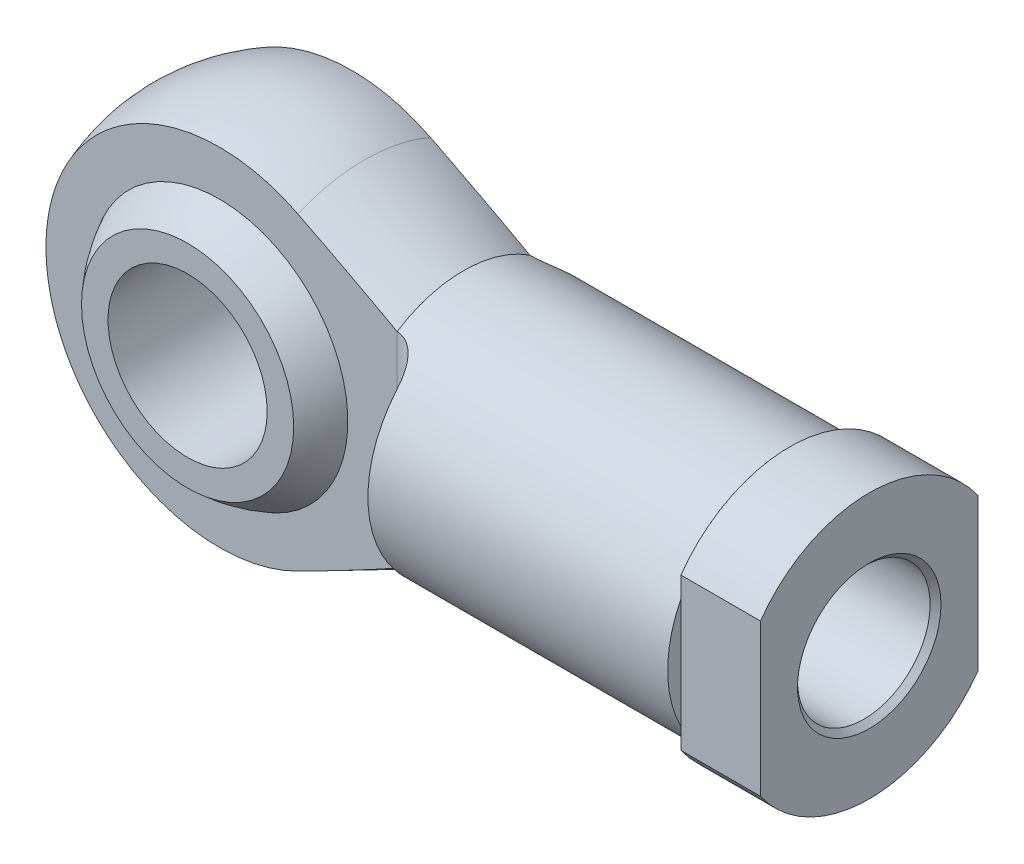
ISO-10303-21;
HEADER;
FILE_DESCRIPTION(('STEP AP214'),'2;1');
FILE_NAME('part.step','',(''),(''),'','','');
FILE_SCHEMA(('AUTOMOTIVE_DESIGN { 1 0 10303 214 1 1 1 1 }'));
ENDSEC;
DATA;
#1=APPLICATION_CONTEXT('core data for automotive mechanical design processes');
#2=APPLICATION_PROTOCOL_DEFINITION('international standard','automotive_design',2000,#1);
#3=PRODUCT_CONTEXT('',#1,'mechanical');
#4=PRODUCT('Part','Part','',(#3));
#5=PRODUCT_RELATED_PRODUCT_CATEGORY('part','',(#4));
#6=PRODUCT_DEFINITION_FORMATION('','',#4);
#7=PRODUCT_DEFINITION_CONTEXT('part definition',#1,'design');
#8=PRODUCT_DEFINITION('design','',#6,#7);
#9=PRODUCT_DEFINITION_SHAPE('','',#8);
#10=(LENGTH_UNIT() NAMED_UNIT(*) SI_UNIT(.MILLI.,.METRE.));
#11=(NAMED_UNIT(*) PLANE_ANGLE_UNIT() SI_UNIT($,.RADIAN.));
#12=(NAMED_UNIT(*) SI_UNIT($,.STERADIAN.) SOLID_ANGLE_UNIT());
#13=UNCERTAINTY_MEASURE_WITH_UNIT(LENGTH_MEASURE(1.E-05),#10,'distance_accuracy_value','');
#14=(GEOMETRIC_REPRESENTATION_CONTEXT(3) GLOBAL_UNCERTAINTY_ASSIGNED_CONTEXT((#13)) GLOBAL_UNIT_ASSIGNED_CONTEXT((#10,
#11,#12)) REPRESENTATION_CONTEXT('',''));
#15=CARTESIAN_POINT('',(0.,0.,0.));
#16=DIRECTION('',(0.,0.,1.));
#17=DIRECTION('',(1.,0.,0.));
#18=AXIS2_PLACEMENT_3D('',#15,#16,#17);
#19=CARTESIAN_POINT('',(-130.,0.,-18.5));
#20=DIRECTION('',(0.,0.,-1.));
#21=DIRECTION('',(-1.,0.,0.));
#22=AXIS2_PLACEMENT_3D('',#19,#20,#21);
#23=PLANE('',#22);
#24=CARTESIAN_POINT('',(-110.,0.,-18.5));
#25=DIRECTION('',(0.,0.,-1.));
#26=DIRECTION('',(-1.,0.,0.));
#27=AXIS2_PLACEMENT_3D('',#24,#25,#26);
#28=CIRCLE('',#27,15.);
#29=CARTESIAN_POINT('',(-125.,0.,-18.5));
#30=VERTEX_POINT('',#29);
#31=EDGE_CURVE('E58',#30,#30,#28,.T.);
#32=ORIENTED_EDGE('',*,*,#31,.F.);
#33=EDGE_LOOP('',(#32));
#34=FACE_BOUND('',#33,.T.);
#35=CARTESIAN_POINT('',(-110.,0.,-18.5));
#36=DIRECTION('',(0.,0.,-1.));
#37=DIRECTION('',(-1.,0.,0.));
#38=AXIS2_PLACEMENT_3D('',#35,#36,#37);
#39=CIRCLE('',#38,20.);
#40=CARTESIAN_POINT('',(-130.,0.,-18.5));
#41=VERTEX_POINT('',#40);
#42=EDGE_CURVE('E12',#41,#41,#39,.T.);
#43=ORIENTED_EDGE('',*,*,#42,.T.);
#44=EDGE_LOOP('',(#43));
#45=FACE_BOUND('',#44,.T.);
#46=ADVANCED_FACE('F47',(#34,#45),#23,.T.);
#47=CARTESIAN_POINT('',(-110.,0.,0.));
#48=DIRECTION('',(0.,0.,-1.));
#49=DIRECTION('',(-1.,0.,0.));
#50=AXIS2_PLACEMENT_3D('',#47,#48,#49);
#51=SPHERICAL_SURFACE('',#50,27.2442654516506);
#52=CARTESIAN_POINT('',(-110.,0.,18.5));
#53=DIRECTION('',(0.,0.,-1.));
#54=DIRECTION('',(-1.,0.,0.));
#55=AXIS2_PLACEMENT_3D('',#52,#53,#54);
#56=CIRCLE('',#55,20.);
#57=CARTESIAN_POINT('',(-130.,0.,18.5));
#58=VERTEX_POINT('',#57);
#59=EDGE_CURVE('E54',#58,#58,#56,.T.);
#60=CARTESIAN_POINT('',(-130.,0.,18.5));
#61=CARTESIAN_POINT('',(-130.2877028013,0.,18.1889813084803));
#62=CARTESIAN_POINT('',(-130.568138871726,0.,17.871241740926));
#63=CARTESIAN_POINT('',(-131.113893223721,0.,17.2230341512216));
#64=CARTESIAN_POINT('',(-131.379211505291,0.,16.8925661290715));
#65=CARTESIAN_POINT('',(-131.894145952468,0.,16.2196149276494));
#66=CARTESIAN_POINT('',(-132.143762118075,0.,15.8771317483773));
#67=CARTESIAN_POINT('',(-132.626750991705,0.,15.1808970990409));
#68=CARTESIAN_POINT('',(-132.860123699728,0.,14.8271456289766));
#69=CARTESIAN_POINT('',(-133.310117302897,0.,14.1091437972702));
#70=CARTESIAN_POINT('',(-133.526738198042,0.,13.7448934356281));
#71=CARTESIAN_POINT('',(-133.942756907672,0.,13.0066866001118));
#72=CARTESIAN_POINT('',(-134.142154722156,0.,12.6327301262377));
#73=CARTESIAN_POINT('',(-134.52329331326,0.,11.8759248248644));
#74=CARTESIAN_POINT('',(-134.705034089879,0.,11.4930759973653));
#75=CARTESIAN_POINT('',(-135.050463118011,0.,10.7193191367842));
#76=CARTESIAN_POINT('',(-135.214151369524,0.,10.3284111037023));
#77=CARTESIAN_POINT('',(-135.523119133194,0.,9.53938650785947));
#78=CARTESIAN_POINT('',(-135.668398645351,0.,9.14126994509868));
#79=CARTESIAN_POINT('',(-135.940232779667,0.,8.33869465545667));
#80=CARTESIAN_POINT('',(-136.066787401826,0.,7.93423592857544));
#81=CARTESIAN_POINT('',(-136.300896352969,0.,7.11985647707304));
#82=CARTESIAN_POINT('',(-136.408450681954,0.,6.70993575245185));
#83=CARTESIAN_POINT('',(-136.604324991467,0.,5.88552435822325));
#84=CARTESIAN_POINT('',(-136.692644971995,0.,5.47103368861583));
#85=CARTESIAN_POINT('',(-136.849858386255,0.,4.63838440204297));
#86=CARTESIAN_POINT('',(-136.918751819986,0.,4.22022578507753));
#87=CARTESIAN_POINT('',(-137.036962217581,0.,3.38115058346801));
#88=CARTESIAN_POINT('',(-137.086279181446,0.,2.96023399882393));
#89=CARTESIAN_POINT('',(-137.165229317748,0.,2.11655884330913));
#90=CARTESIAN_POINT('',(-137.194862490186,0.,1.69380027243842));
#91=CARTESIAN_POINT('',(-137.234380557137,0.,0.847361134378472));
#92=CARTESIAN_POINT('',(-137.244265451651,0.,0.423680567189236));
#93=CARTESIAN_POINT('',(-137.244265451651,0.,-0.423680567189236));
#94=CARTESIAN_POINT('',(-137.234380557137,0.,-0.847361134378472));
#95=CARTESIAN_POINT('',(-137.194862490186,0.,-1.69380027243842));
#96=CARTESIAN_POINT('',(-137.165229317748,0.,-2.11655884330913));
#97=CARTESIAN_POINT('',(-137.086279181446,0.,-2.96023399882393));
#98=CARTESIAN_POINT('',(-137.036962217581,0.,-3.38115058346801));
#99=CARTESIAN_POINT('',(-136.918751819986,0.,-4.22022578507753));
#100=CARTESIAN_POINT('',(-136.849858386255,0.,-4.63838440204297));
#101=CARTESIAN_POINT('',(-136.692644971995,0.,-5.47103368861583));
#102=CARTESIAN_POINT('',(-136.604324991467,0.,-5.88552435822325));
#103=CARTESIAN_POINT('',(-136.408450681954,0.,-6.70993575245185));
#104=CARTESIAN_POINT('',(-136.300896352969,0.,-7.11985647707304));
#105=CARTESIAN_POINT('',(-136.066787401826,0.,-7.93423592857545));
#106=CARTESIAN_POINT('',(-135.940232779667,0.,-8.33869465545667));
#107=CARTESIAN_POINT('',(-135.668398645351,0.,-9.14126994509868));
#108=CARTESIAN_POINT('',(-135.523119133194,0.,-9.53938650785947));
#109=CARTESIAN_POINT('',(-135.214151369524,0.,-10.3284111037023));
#110=CARTESIAN_POINT('',(-135.050463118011,0.,-10.7193191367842));
#111=CARTESIAN_POINT('',(-134.705034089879,0.,-11.4930759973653));
#112=CARTESIAN_POINT('',(-134.52329331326,0.,-11.8759248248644));
#113=CARTESIAN_POINT('',(-134.142154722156,0.,-12.6327301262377));
#114=CARTESIAN_POINT('',(-133.942756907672,0.,-13.0066866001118));
#115=CARTESIAN_POINT('',(-133.526738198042,0.,-13.7448934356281));
#116=CARTESIAN_POINT('',(-133.310117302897,0.,-14.1091437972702));
#117=CARTESIAN_POINT('',(-132.860123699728,0.,-14.8271456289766));
#118=CARTESIAN_POINT('',(-132.626750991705,0.,-15.1808970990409));
#119=CARTESIAN_POINT('',(-132.143762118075,0.,-15.8771317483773));
#120=CARTESIAN_POINT('',(-131.894145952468,0.,-16.2196149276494));
#121=CARTESIAN_POINT('',(-131.379211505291,0.,-16.8925661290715));
#122=CARTESIAN_POINT('',(-131.113893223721,0.,-17.2230341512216));
#123=CARTESIAN_POINT('',(-130.568138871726,0.,-17.871241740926));
#124=CARTESIAN_POINT('',(-130.2877028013,0.,-18.1889813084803));
#125=CARTESIAN_POINT('',(-130.,0.,-18.5));
#126=B_SPLINE_CURVE_WITH_KNOTS('',3,(#60,#61,#62,#63,#64,#65,#66,#67,#68,#69,#70,#71,#72,#73,
#74,#75,#76,#77,#78,#79,#80,#81,#82,#83,#84,#85,#86,#87,#88,#89,#90,#91,#92,#93,#94,#95,#96,#97,
#98,#99,#100,#101,#102,#103,#104,#105,#106,#107,#108,#109,#110,#111,#112,#113,#114,#115,#116,
#117,#118,#119,#120,#121,#122,#123,#124,#125),.UNSPECIFIED.,.F.,.F.,(4,2,2,2,2,2,2,2,2,2,2,2,2,
2,2,2,2,2,2,2,2,2,2,2,2,2,2,2,2,2,2,2,4),(0.,1.27092646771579,2.54185293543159,3.81277940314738,
5.08370587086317,6.35463233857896,7.62555880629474,8.89648527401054,10.1674117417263,
11.4383382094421,12.7092646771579,13.9801911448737,15.2511176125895,16.5220440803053,
17.7929705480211,19.0638970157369,20.3348234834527,21.6057499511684,22.8766764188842,
24.1476028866,25.4185293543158,26.6894558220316,27.9603822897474,29.2313087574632,
30.502235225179,31.7731616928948,33.0440881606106,34.3150146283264,35.5859410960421,
36.8568675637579,38.1277940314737,39.3987204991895,40.6696469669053),.UNSPECIFIED.);
#127=EDGE_CURVE('BSEAM72',#58,#41,#126,.T.);
#128=ORIENTED_EDGE('',*,*,#59,.T.);
#129=ORIENTED_EDGE('',*,*,#42,.F.);
#130=ORIENTED_EDGE('',*,*,#127,.T.);
#131=ORIENTED_EDGE('',*,*,#127,.F.);
#132=EDGE_LOOP('',(#128,#130,#129,#131));
#133=FACE_BOUND('',#132,.T.);
#134=ADVANCED_FACE('F72',(#133),#51,.T.);
#135=CARTESIAN_POINT('',(-130.,0.,18.5));
#136=DIRECTION('',(0.,0.,1.));
#137=DIRECTION('',(1.,0.,0.));
#138=AXIS2_PLACEMENT_3D('',#135,#136,#137);
#139=PLANE('',#138);
#140=CARTESIAN_POINT('',(-110.,0.,18.5));
#141=DIRECTION('',(0.,0.,1.));
#142=DIRECTION('',(1.,0.,0.));
#143=AXIS2_PLACEMENT_3D('',#140,#141,#142);
#144=CIRCLE('',#143,15.);
#145=CARTESIAN_POINT('',(-95.,0.,18.5));
#146=VERTEX_POINT('',#145);
#147=EDGE_CURVE('E50',#146,#146,#144,.T.);
#148=ORIENTED_EDGE('',*,*,#147,.F.);
#149=EDGE_LOOP('',(#148));
#150=FACE_BOUND('',#149,.T.);
#151=ORIENTED_EDGE('',*,*,#59,.F.);
#152=EDGE_LOOP('',(#151));
#153=FACE_BOUND('',#152,.T.);
#154=ADVANCED_FACE('F69',(#150,#153),#139,.T.);
#155=CARTESIAN_POINT('',(-110.,0.,-25.));
#156=DIRECTION('',(0.,0.,1.));
#157=DIRECTION('',(1.,0.,0.));
#158=AXIS2_PLACEMENT_3D('',#155,#156,#157);
#159=CYLINDRICAL_SURFACE('',#158,15.);
#160=ORIENTED_EDGE('',*,*,#31,.T.);
#161=EDGE_LOOP('',(#160));
#162=FACE_BOUND('',#161,.T.);
#163=ORIENTED_EDGE('',*,*,#147,.T.);
#164=EDGE_LOOP('',(#163));
#165=FACE_BOUND('',#164,.T.);
#166=ADVANCED_FACE('F67',(#162,#165),#159,.F.);
#167=CLOSED_SHELL('',(#46,#134,#154,#166));
#168=MANIFOLD_SOLID_BREP('B2',#167);
#169=CARTESIAN_POINT('',(0.,0.,0.));
#170=DIRECTION('',(1.,0.,0.));
#171=DIRECTION('',(0.,1.,0.));
#172=AXIS2_PLACEMENT_3D('',#169,#170,#171);
#173=CYLINDRICAL_SURFACE('',#172,25.);
#174=CARTESIAN_POINT('',(0.,0.,0.));
#175=DIRECTION('',(1.,0.,0.));
#176=DIRECTION('',(0.,1.,0.));
#177=AXIS2_PLACEMENT_3D('',#174,#175,#176);
#178=CIRCLE('',#177,25.);
#179=CARTESIAN_POINT('',(0.,-14.3090880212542,20.5));
#180=VERTEX_POINT('',#179);
#181=CARTESIAN_POINT('',(0.,-14.3090880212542,-20.5));
#182=VERTEX_POINT('',#181);
#183=EDGE_CURVE('E348',#180,#182,#178,.T.);
#184=ORIENTED_EDGE('',*,*,#183,.F.);
#185=DIRECTION('',(1.,0.,0.));
#186=VECTOR('',#185,1.);
#187=CARTESIAN_POINT('',(0.,-14.3090880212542,20.5));
#188=LINE('',#187,#186);
#189=CARTESIAN_POINT('',(-15.,-14.3090880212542,20.5));
#190=VERTEX_POINT('',#189);
#191=EDGE_CURVE('E130',#180,#190,#188,.F.);
#192=ORIENTED_EDGE('',*,*,#191,.T.);
#193=CARTESIAN_POINT('',(-15.,0.,0.));
#194=DIRECTION('',(1.,0.,0.));
#195=DIRECTION('',(0.,1.,0.));
#196=AXIS2_PLACEMENT_3D('',#193,#194,#195);
#197=CIRCLE('',#196,25.);
#198=CARTESIAN_POINT('',(-15.,-14.3090880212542,-20.5));
#199=VERTEX_POINT('',#198);
#200=EDGE_CURVE('E376',#190,#199,#197,.T.);
#201=ORIENTED_EDGE('',*,*,#200,.T.);
#202=DIRECTION('',(1.,0.,0.));
#203=VECTOR('',#202,1.);
#204=CARTESIAN_POINT('',(0.,-14.3090880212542,-20.5));
#205=LINE('',#204,#203);
#206=EDGE_CURVE('E224',#199,#182,#205,.T.);
#207=ORIENTED_EDGE('',*,*,#206,.T.);
#208=EDGE_LOOP('',(#184,#192,#201,#207));
#209=FACE_BOUND('',#208,.T.);
#210=ADVANCED_FACE('F108',(#209),#173,.T.);
#211=CARTESIAN_POINT('',(-15.,14.3090880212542,-20.5));
#212=VERTEX_POINT('',#211);
#213=CARTESIAN_POINT('',(-15.,14.3090880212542,20.5));
#214=VERTEX_POINT('',#213);
#215=EDGE_CURVE('E359',#212,#214,#197,.T.);
#216=ORIENTED_EDGE('',*,*,#215,.T.);
#217=DIRECTION('',(1.,0.,0.));
#218=VECTOR('',#217,1.);
#219=CARTESIAN_POINT('',(0.,14.3090880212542,20.5));
#220=LINE('',#219,#218);
#221=CARTESIAN_POINT('',(0.,14.3090880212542,20.5));
#222=VERTEX_POINT('',#221);
#223=EDGE_CURVE('E228',#214,#222,#220,.T.);
#224=ORIENTED_EDGE('',*,*,#223,.T.);
#225=CARTESIAN_POINT('',(0.,14.3090880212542,-20.5));
#226=VERTEX_POINT('',#225);
#227=EDGE_CURVE('E295',#226,#222,#178,.T.);
#228=ORIENTED_EDGE('',*,*,#227,.F.);
#229=DIRECTION('',(1.,0.,0.));
#230=VECTOR('',#229,1.);
#231=CARTESIAN_POINT('',(0.,14.3090880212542,-20.5));
#232=LINE('',#231,#230);
#233=EDGE_CURVE('E122',#226,#212,#232,.F.);
#234=ORIENTED_EDGE('',*,*,#233,.T.);
#235=EDGE_LOOP('',(#216,#224,#228,#234));
#236=FACE_BOUND('',#235,.T.);
#237=ADVANCED_FACE('F340',(#236),#173,.T.);
#238=CARTESIAN_POINT('',(-15.,25.,0.));
#239=DIRECTION('',(-1.,0.,0.));
#240=DIRECTION('',(0.,-1.,0.));
#241=AXIS2_PLACEMENT_3D('',#238,#239,#240);
#242=PLANE('',#241);
#243=ORIENTED_EDGE('',*,*,#200,.F.);
#244=DIRECTION('',(0.,-1.,0.));
#245=VECTOR('',#244,1.);
#246=CARTESIAN_POINT('',(-15.,-35.,20.5));
#247=LINE('',#246,#245);
#248=CARTESIAN_POINT('',(-15.,-10.4283268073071,20.5));
#249=VERTEX_POINT('',#248);
#250=EDGE_CURVE('E220',#249,#190,#247,.T.);
#251=ORIENTED_EDGE('',*,*,#250,.F.);
#252=CARTESIAN_POINT('',(-15.,0.,0.));
#253=DIRECTION('',(1.,0.,0.));
#254=DIRECTION('',(0.,1.,0.));
#255=AXIS2_PLACEMENT_3D('',#252,#253,#254);
#256=CIRCLE('',#255,23.);
#257=CARTESIAN_POINT('',(-15.,-10.4283268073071,-20.5));
#258=VERTEX_POINT('',#257);
#259=EDGE_CURVE('E375',#249,#258,#256,.T.);
#260=ORIENTED_EDGE('',*,*,#259,.T.);
#261=DIRECTION('',(0.,1.,0.));
#262=VECTOR('',#261,1.);
#263=CARTESIAN_POINT('',(-15.,35.,-20.5));
#264=LINE('',#263,#262);
#265=EDGE_CURVE('E214',#199,#258,#264,.T.);
#266=ORIENTED_EDGE('',*,*,#265,.F.);
#267=EDGE_LOOP('',(#243,#251,#260,#266));
#268=FACE_BOUND('',#267,.T.);
#269=ADVANCED_FACE('F302',(#268),#242,.T.);
#270=CARTESIAN_POINT('',(-15.,10.4283268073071,-20.5));
#271=VERTEX_POINT('',#270);
#272=CARTESIAN_POINT('',(-15.,10.4283268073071,20.5));
#273=VERTEX_POINT('',#272);
#274=EDGE_CURVE('E367',#271,#273,#256,.T.);
#275=ORIENTED_EDGE('',*,*,#274,.T.);
#276=EDGE_CURVE('E223',#214,#273,#247,.T.);
#277=ORIENTED_EDGE('',*,*,#276,.F.);
#278=ORIENTED_EDGE('',*,*,#215,.F.);
#279=EDGE_CURVE('E209',#271,#212,#264,.T.);
#280=ORIENTED_EDGE('',*,*,#279,.F.);
#281=EDGE_LOOP('',(#275,#277,#278,#280));
#282=FACE_BOUND('',#281,.T.);
#283=ADVANCED_FACE('F327',(#282),#242,.T.);
#284=CARTESIAN_POINT('',(0.,0.,0.));
#285=DIRECTION('',(1.,0.,0.));
#286=DIRECTION('',(0.,1.,0.));
#287=AXIS2_PLACEMENT_3D('',#284,#285,#286);
#288=PLANE('',#287);
#289=CARTESIAN_POINT('',(0.,0.,0.));
#290=DIRECTION('',(1.,0.,0.));
#291=DIRECTION('',(0.,0.,-1.));
#292=AXIS2_PLACEMENT_3D('',#289,#290,#291);
#293=CIRCLE('',#292,13.525);
#294=CARTESIAN_POINT('',(0.,0.,-13.525));
#295=VERTEX_POINT('',#294);
#296=EDGE_CURVE('E216',#295,#295,#293,.T.);
#297=ORIENTED_EDGE('',*,*,#296,.F.);
#298=EDGE_LOOP('',(#297));
#299=FACE_BOUND('',#298,.T.);
#300=ORIENTED_EDGE('',*,*,#227,.T.);
#301=DIRECTION('',(0.,-1.,0.));
#302=VECTOR('',#301,1.);
#303=CARTESIAN_POINT('',(0.,0.,20.5));
#304=LINE('',#303,#302);
#305=EDGE_CURVE('E45',#222,#180,#304,.T.);
#306=ORIENTED_EDGE('',*,*,#305,.T.);
#307=ORIENTED_EDGE('',*,*,#183,.T.);
#308=DIRECTION('',(0.,1.,0.));
#309=VECTOR('',#308,1.);
#310=CARTESIAN_POINT('',(0.,0.,-20.5));
#311=LINE('',#310,#309);
#312=EDGE_CURVE('E115',#182,#226,#311,.T.);
#313=ORIENTED_EDGE('',*,*,#312,.T.);
#314=EDGE_LOOP('',(#300,#306,#307,#313));
#315=FACE_BOUND('',#314,.T.);
#316=ADVANCED_FACE('F325',(#299,#315),#288,.T.);
#317=CARTESIAN_POINT('',(-76.5066037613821,0.,0.));
#318=DIRECTION('',(-1.,0.,0.));
#319=DIRECTION('',(0.,-1.,0.));
#320=AXIS2_PLACEMENT_3D('',#317,#318,#319);
#321=CONICAL_SURFACE('',#320,23.,0.436332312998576);
#322=CARTESIAN_POINT('',(-134.892949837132,48.6456689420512,-12.5));
#323=CARTESIAN_POINT('',(-133.556597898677,48.0022676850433,-12.5));
#324=CARTESIAN_POINT('',(-132.220550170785,47.3582341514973,-12.5));
#325=CARTESIAN_POINT('',(-129.549153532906,46.0687174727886,-12.5));
#326=CARTESIAN_POINT('',(-128.213804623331,45.423234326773,-12.5));
#327=CARTESIAN_POINT('',(-125.5438485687,44.1306103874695,-12.5));
#328=CARTESIAN_POINT('',(-124.209241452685,43.4834695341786,-12.5));
#329=CARTESIAN_POINT('',(-121.540935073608,42.1873200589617,-12.5));
#330=CARTESIAN_POINT('',(-120.207235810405,41.5383114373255,-12.5));
#331=CARTESIAN_POINT('',(-116.203859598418,39.5862348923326,-12.5));
#332=CARTESIAN_POINT('',(-113.535738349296,38.2799707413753,-12.5));
#333=CARTESIAN_POINT('',(-109.537819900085,36.3120069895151,-12.5));
#334=CARTESIAN_POINT('',(-108.205909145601,35.6546001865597,-12.5));
#335=CARTESIAN_POINT('',(-105.543760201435,34.3364095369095,-12.5));
#336=CARTESIAN_POINT('',(-104.213522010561,33.6756256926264,-12.5));
#337=CARTESIAN_POINT('',(-101.578129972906,32.3615784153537,-12.5));
#338=CARTESIAN_POINT('',(-100.272941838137,31.708383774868,-12.5));
#339=CARTESIAN_POINT('',(-97.6648803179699,30.3973916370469,-12.5));
#340=CARTESIAN_POINT('',(-96.3620069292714,29.7395941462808,-12.5));
#341=CARTESIAN_POINT('',(-93.7589644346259,28.4183815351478,-12.5));
#342=CARTESIAN_POINT('',(-92.458795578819,27.7549659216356,-12.5));
#343=CARTESIAN_POINT('',(-89.8619550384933,26.4213310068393,-12.5));
#344=CARTESIAN_POINT('',(-88.5652833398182,25.7511117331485,-12.5));
#345=CARTESIAN_POINT('',(-85.9772259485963,24.4026589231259,-12.5));
#346=CARTESIAN_POINT('',(-84.6858372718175,23.7244311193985,-12.5));
#347=CARTESIAN_POINT('',(-82.1087045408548,22.3572496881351,-12.5));
#348=CARTESIAN_POINT('',(-80.8229605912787,21.6682958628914,-12.5));
#349=CARTESIAN_POINT('',(-78.9001145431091,20.6244612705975,-12.5));
#350=CARTESIAN_POINT('',(-78.2601737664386,20.2748081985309,-12.5));
#351=CARTESIAN_POINT('',(-76.9825115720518,19.5714725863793,-12.5));
#352=CARTESIAN_POINT('',(-76.3447901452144,19.2177900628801,-12.5));
#353=CARTESIAN_POINT('',(-75.0719827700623,18.5057655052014,-12.5));
#354=CARTESIAN_POINT('',(-74.4368967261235,18.1474236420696,-12.5));
#355=CARTESIAN_POINT('',(-73.1698436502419,17.4252729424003,-12.5));
#356=CARTESIAN_POINT('',(-72.5378765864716,17.0614641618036,-12.5));
#357=CARTESIAN_POINT('',(-71.5592770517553,16.4913916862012,-12.5));
#358=CARTESIAN_POINT('',(-71.2113349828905,16.2873749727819,-12.5));
#359=CARTESIAN_POINT('',(-70.5167413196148,15.8771503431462,-12.5));
#360=CARTESIAN_POINT('',(-70.1700897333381,15.6709424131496,-12.5));
#361=CARTESIAN_POINT('',(-69.4781995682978,15.2560814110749,-12.5));
#362=CARTESIAN_POINT('',(-69.1329611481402,15.0474280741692,-12.5));
#363=CARTESIAN_POINT('',(-68.4441315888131,14.6274244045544,-12.5));
#364=CARTESIAN_POINT('',(-68.1005404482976,14.4160740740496,-12.5));
#365=CARTESIAN_POINT('',(-67.0683847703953,13.7749395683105,-12.5));
#366=CARTESIAN_POINT('',(-66.3826395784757,13.3405807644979,-12.5));
#367=CARTESIAN_POINT('',(-65.3615994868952,12.6775503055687,-12.5));
#368=CARTESIAN_POINT('',(-65.0225517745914,12.4546493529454,-12.5));
#369=CARTESIAN_POINT('',(-64.3473854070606,12.0044586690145,-12.5));
#370=CARTESIAN_POINT('',(-64.0112667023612,11.7771690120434,-12.5));
#371=CARTESIAN_POINT('',(-63.339946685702,11.3158384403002,-12.5));
#372=CARTESIAN_POINT('',(-63.0047714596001,11.0817595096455,-12.5));
#373=CARTESIAN_POINT('',(-62.3385862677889,10.6077247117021,-12.5));
#374=CARTESIAN_POINT('',(-62.0075763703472,10.367768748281,-12.5));
#375=CARTESIAN_POINT('',(-61.3502359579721,9.88076144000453,-12.5));
#376=CARTESIAN_POINT('',(-61.0239110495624,9.63370250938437,-12.5));
#377=CARTESIAN_POINT('',(-60.3774841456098,9.13157654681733,-12.5));
#378=CARTESIAN_POINT('',(-60.057381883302,8.87650985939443,-12.5));
#379=CARTESIAN_POINT('',(-59.427015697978,8.35859864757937,-12.5));
#380=CARTESIAN_POINT('',(-59.1167009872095,8.09581616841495,-12.5));
#381=CARTESIAN_POINT('',(-58.5057588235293,7.55903561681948,-12.5));
#382=CARTESIAN_POINT('',(-58.2051333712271,7.28503525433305,-12.5));
#383=CARTESIAN_POINT('',(-57.6172023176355,6.72420118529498,-12.5));
#384=CARTESIAN_POINT('',(-57.3298708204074,6.43739476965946,-12.5));
#385=CARTESIAN_POINT('',(-56.7722152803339,5.84779456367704,-12.5));
#386=CARTESIAN_POINT('',(-56.5018814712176,5.54501014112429,-12.5));
#387=CARTESIAN_POINT('',(-56.0958556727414,5.05465655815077,-12.5));
#388=CARTESIAN_POINT('',(-55.9522995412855,4.87359956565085,-12.5));
#389=CARTESIAN_POINT('',(-55.6743110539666,4.50453620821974,-12.5));
#390=CARTESIAN_POINT('',(-55.5398799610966,4.31652888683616,-12.5));
#391=CARTESIAN_POINT('',(-55.2821479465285,3.93299121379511,-12.5));
#392=CARTESIAN_POINT('',(-55.1588457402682,3.7374617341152,-12.5));
#393=CARTESIAN_POINT('',(-54.9258491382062,3.33854150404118,-12.5));
#394=CARTESIAN_POINT('',(-54.8161522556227,3.13515219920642,-12.5));
#395=CARTESIAN_POINT('',(-54.5474385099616,2.58554734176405,-12.5));
#396=CARTESIAN_POINT('',(-54.402446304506,2.23208275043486,-12.5));
#397=CARTESIAN_POINT('',(-54.2298868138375,1.68810889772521,-12.5));
#398=CARTESIAN_POINT('',(-54.179869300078,1.50458594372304,-12.5));
#399=CARTESIAN_POINT('',(-54.096415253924,1.13374396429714,-12.5));
#400=CARTESIAN_POINT('',(-54.062978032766,0.946425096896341,-12.5));
#401=CARTESIAN_POINT('',(-54.0138133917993,0.567626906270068,-12.5));
#402=CARTESIAN_POINT('',(-53.9982591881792,0.376124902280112,-12.5));
#403=CARTESIAN_POINT('',(-53.9861313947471,-0.00748069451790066,-12.5));
#404=CARTESIAN_POINT('',(-53.9895571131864,-0.199584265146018,-12.5));
#405=CARTESIAN_POINT('',(-54.0152424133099,-0.582645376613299,-12.5));
#406=CARTESIAN_POINT('',(-54.0375147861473,-0.773602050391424,-12.5));
#407=CARTESIAN_POINT('',(-54.0999383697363,-1.15255819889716,-12.5));
#408=CARTESIAN_POINT('',(-54.1400921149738,-1.34055725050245,-12.5));
#409=CARTESIAN_POINT('',(-54.2438412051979,-1.73967866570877,-12.5));
#410=CARTESIAN_POINT('',(-54.3100187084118,-1.95012680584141,-12.5));
#411=CARTESIAN_POINT('',(-54.4610330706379,-2.36424000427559,-12.5));
#412=CARTESIAN_POINT('',(-54.5458790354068,-2.56790169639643,-12.5));
#413=CARTESIAN_POINT('',(-54.7314557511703,-2.96817681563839,-12.5));
#414=CARTESIAN_POINT('',(-54.8322112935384,-3.16477864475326,-12.5));
#415=CARTESIAN_POINT('',(-55.0468561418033,-3.55060620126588,-12.5));
#416=CARTESIAN_POINT('',(-55.160745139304,-3.73983210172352,-12.5));
#417=CARTESIAN_POINT('',(-55.4208701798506,-4.14468257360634,-12.5));
#418=CARTESIAN_POINT('',(-55.5692392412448,-4.35893065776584,-12.5));
#419=CARTESIAN_POINT('',(-55.8781320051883,-4.77852094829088,-12.5));
#420=CARTESIAN_POINT('',(-56.0386601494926,-4.98385985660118,-12.5));
#421=CARTESIAN_POINT('',(-56.3697148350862,-5.38675799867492,-12.5));
#422=CARTESIAN_POINT('',(-56.5402552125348,-5.58430580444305,-12.5));
#423=CARTESIAN_POINT('',(-56.8893192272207,-5.97222623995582,-12.5));
#424=CARTESIAN_POINT('',(-57.0678438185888,-6.162598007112,-12.5));
#425=CARTESIAN_POINT('',(-57.4326497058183,-6.53820457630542,-12.5));
#426=CARTESIAN_POINT('',(-57.6189746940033,-6.72339679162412,-12.5));
#427=CARTESIAN_POINT('',(-57.9971357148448,-7.08805742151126,-12.5));
#428=CARTESIAN_POINT('',(-58.1889718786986,-7.26752569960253,-12.5));
#429=CARTESIAN_POINT('',(-58.5770748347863,-7.62121087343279,-12.5));
#430=CARTESIAN_POINT('',(-58.7733371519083,-7.79543269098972,-12.5));
#431=CARTESIAN_POINT('',(-59.1697636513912,-8.1393523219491,-12.5));
#432=CARTESIAN_POINT('',(-59.3699277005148,-8.30905028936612,-12.5));
#433=CARTESIAN_POINT('',(-60.0080251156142,-8.83922366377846,-12.5));
#434=CARTESIAN_POINT('',(-60.452080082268,-9.1923418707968,-12.5));
#435=CARTESIAN_POINT('',(-61.3516007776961,-9.88378544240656,-12.5));
#436=CARTESIAN_POINT('',(-61.8070687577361,-10.2221078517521,-12.5));
#437=CARTESIAN_POINT('',(-62.7269563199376,-10.8869995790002,-12.5));
#438=CARTESIAN_POINT('',(-63.1913818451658,-11.213560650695,-12.5));
#439=CARTESIAN_POINT('',(-64.1269332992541,-11.8568322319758,-12.5));
#440=CARTESIAN_POINT('',(-64.5980587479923,-12.1735434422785,-12.5));
#441=CARTESIAN_POINT('',(-65.5468886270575,-12.7996020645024,-12.5));
#442=CARTESIAN_POINT('',(-66.0246067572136,-13.1089286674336,-12.5));
#443=CARTESIAN_POINT('',(-66.9844356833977,-13.7206928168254,-12.5));
#444=CARTESIAN_POINT('',(-67.4665465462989,-14.0231302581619,-12.5));
#445=CARTESIAN_POINT('',(-68.4342018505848,-14.6220340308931,-12.5));
#446=CARTESIAN_POINT('',(-68.919744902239,-14.9185026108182,-12.5));
#447=CARTESIAN_POINT('',(-69.8938658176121,-15.5064157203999,-12.5));
#448=CARTESIAN_POINT('',(-70.3824437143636,-15.7978601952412,-12.5));
#449=CARTESIAN_POINT('',(-71.8537755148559,-16.6667461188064,-12.5));
#450=CARTESIAN_POINT('',(-72.8403814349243,-17.2376668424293,-12.5));
#451=CARTESIAN_POINT('',(-74.821207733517,-18.3662861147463,-12.5));
#452=CARTESIAN_POINT('',(-75.815428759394,-18.9239835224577,-12.5));
#453=CARTESIAN_POINT('',(-77.8081241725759,-20.0281025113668,-12.5));
#454=CARTESIAN_POINT('',(-78.8065897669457,-20.5745399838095,-12.5));
#455=CARTESIAN_POINT('',(-80.8080025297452,-21.6590627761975,-12.5));
#456=CARTESIAN_POINT('',(-81.8109495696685,-22.1971483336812,-12.5));
#457=CARTESIAN_POINT('',(-83.8951396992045,-23.306268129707,-12.5));
#458=CARTESIAN_POINT('',(-84.9766612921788,-23.8767785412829,-12.5));
#459=CARTESIAN_POINT('',(-87.1430559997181,-25.0114049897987,-12.5));
#460=CARTESIAN_POINT('',(-88.2279291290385,-25.5755209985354,-12.5));
#461=CARTESIAN_POINT('',(-90.4004359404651,-26.6984705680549,-12.5));
#462=CARTESIAN_POINT('',(-91.4880696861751,-27.2573040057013,-12.5));
#463=CARTESIAN_POINT('',(-93.6656062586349,-28.3705347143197,-12.5));
#464=CARTESIAN_POINT('',(-94.7555090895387,-28.9249319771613,-12.5));
#465=CARTESIAN_POINT('',(-96.9379764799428,-30.0303546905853,-12.5));
#466=CARTESIAN_POINT('',(-98.0305423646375,-30.5813775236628,-12.5));
#467=CARTESIAN_POINT('',(-100.217291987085,-31.6802044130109,-12.5));
#468=CARTESIAN_POINT('',(-101.311475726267,-32.2280084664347,-12.5));
#469=CARTESIAN_POINT('',(-104.59606530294,-33.8672659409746,-12.5));
#470=CARTESIAN_POINT('',(-106.788537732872,-34.9545789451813,-12.5));
#471=CARTESIAN_POINT('',(-111.137232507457,-37.1009188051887,-12.5));
#472=CARTESIAN_POINT('',(-113.293379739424,-38.1600980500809,-12.5));
#473=CARTESIAN_POINT('',(-117.608771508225,-40.2721474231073,-12.5));
#474=CARTESIAN_POINT('',(-119.768016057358,-41.3250175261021,-12.5));
#475=CARTESIAN_POINT('',(-124.08709603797,-43.4248399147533,-12.5));
#476=CARTESIAN_POINT('',(-126.246929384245,-44.4717964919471,-12.5));
#477=CARTESIAN_POINT('',(-130.56856839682,-46.5615929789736,-12.5));
#478=CARTESIAN_POINT('',(-132.73037404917,-47.6044329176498,-12.5));
#479=CARTESIAN_POINT('',(-134.892949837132,-48.6456689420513,-12.5));
#480=B_SPLINE_CURVE_WITH_KNOTS('',3,(#322,#323,#324,#325,#326,#327,#328,#329,#330,#331,#332,
#333,#334,#335,#336,#337,#338,#339,#340,#341,#342,#343,#344,#345,#346,#347,#348,#349,#350,#351,
#352,#353,#354,#355,#356,#357,#358,#359,#360,#361,#362,#363,#364,#365,#366,#367,#368,#369,#370,
#371,#372,#373,#374,#375,#376,#377,#378,#379,#380,#381,#382,#383,#384,#385,#386,#387,#388,#389,
#390,#391,#392,#393,#394,#395,#396,#397,#398,#399,#400,#401,#402,#403,#404,#405,#406,#407,#408,
#409,#410,#411,#412,#413,#414,#415,#416,#417,#418,#419,#420,#421,#422,#423,#424,#425,#426,#427,
#428,#429,#430,#431,#432,#433,#434,#435,#436,#437,#438,#439,#440,#441,#442,#443,#444,#445,#446,
#447,#448,#449,#450,#451,#452,#453,#454,#455,#456,#457,#458,#459,#460,#461,#462,#463,#464,#465,
#466,#467,#468,#469,#470,#471,#472,#473,#474,#475,#476,#477,#478,#479),.UNSPECIFIED.,.F.,.F.,(4,
2,2,2,2,2,2,2,2,2,2,2,2,2,2,2,2,2,2,2,2,2,2,2,2,2,2,2,2,2,2,2,2,2,2,2,2,2,2,2,2,2,2,2,2,2,2,2,2,
2,2,2,2,2,2,2,2,2,2,2,2,2,2,2,2,2,2,2,2,2,2,2,2,2,2,2,2,2,4),(0.,4.44951861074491,
8.89903983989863,13.348724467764,17.7984084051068,26.7105533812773,31.1665041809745,
35.6224517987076,40.00098448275,44.3795109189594,48.7584257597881,53.137322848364,57.5132555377,
61.8892689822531,64.0769580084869,66.2646380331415,68.4522379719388,70.6398155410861,
71.8498412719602,73.0598746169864,74.2700402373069,75.4802048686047,77.9152136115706,
79.1324563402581,80.3496784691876,81.5760906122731,82.8025228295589,84.0303174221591,
85.2580592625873,86.4777420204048,87.6976750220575,88.9151219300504,90.1318628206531,
90.824819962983,91.5178728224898,92.2108455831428,92.9036914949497,94.0449177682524,
94.6149454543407,95.1849494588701,95.7604292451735,96.3358880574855,96.9117377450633,
97.487669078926,98.1484568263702,98.8095675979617,99.4717189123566,100.13385468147,
100.91513248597,101.696697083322,102.479368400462,103.26213349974,104.050104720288,
104.838094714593,105.625320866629,106.412520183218,108.114085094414,109.815988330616,
111.519062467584,113.222015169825,114.929305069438,116.636621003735,118.343281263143,
120.049960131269,123.469465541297,126.889264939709,130.303851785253,133.718341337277,
137.386630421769,141.05493567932,144.723326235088,148.391723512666,152.062675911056,
155.73363155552,163.075447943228,170.282202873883,177.488986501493,184.689605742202,
191.890174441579),.UNSPECIFIED.);
#481=CARTESIAN_POINT('',(-95.2083608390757,29.1540290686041,-12.5));
#482=VERTEX_POINT('',#481);
#483=CARTESIAN_POINT('',(-76.5066037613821,19.3067345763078,-12.5));
#484=VERTEX_POINT('',#483);
#485=EDGE_CURVE('E425',#482,#484,#480,.T.);
#486=ORIENTED_EDGE('',*,*,#485,.F.);
#487=CARTESIAN_POINT('',(-95.2083608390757,0.,0.));
#488=DIRECTION('',(1.,0.,0.));
#489=DIRECTION('',(0.,1.,0.));
#490=AXIS2_PLACEMENT_3D('',#487,#488,#489);
#491=CIRCLE('',#490,31.7207725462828);
#492=CARTESIAN_POINT('',(-95.2083608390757,29.154029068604,12.5));
#493=VERTEX_POINT('',#492);
#494=EDGE_CURVE('E352',#482,#493,#491,.T.);
#495=ORIENTED_EDGE('',*,*,#494,.T.);
#496=CARTESIAN_POINT('',(-134.892949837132,-48.6456689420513,12.5));
#497=CARTESIAN_POINT('',(-133.556597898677,-48.0022676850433,12.5));
#498=CARTESIAN_POINT('',(-132.220550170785,-47.3582341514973,12.5));
#499=CARTESIAN_POINT('',(-129.549153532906,-46.0687174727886,12.5));
#500=CARTESIAN_POINT('',(-128.213804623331,-45.423234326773,12.5));
#501=CARTESIAN_POINT('',(-125.5438485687,-44.1306103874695,12.5));
#502=CARTESIAN_POINT('',(-124.209241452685,-43.4834695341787,12.5));
#503=CARTESIAN_POINT('',(-121.540935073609,-42.1873200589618,12.5));
#504=CARTESIAN_POINT('',(-120.207235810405,-41.5383114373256,12.5));
#505=CARTESIAN_POINT('',(-116.203859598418,-39.5862348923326,12.5));
#506=CARTESIAN_POINT('',(-113.535738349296,-38.2799707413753,12.5));
#507=CARTESIAN_POINT('',(-109.537819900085,-36.3120069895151,12.5));
#508=CARTESIAN_POINT('',(-108.205909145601,-35.6546001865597,12.5));
#509=CARTESIAN_POINT('',(-105.543760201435,-34.3364095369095,12.5));
#510=CARTESIAN_POINT('',(-104.213522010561,-33.6756256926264,12.5));
#511=CARTESIAN_POINT('',(-101.578129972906,-32.3615784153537,12.5));
#512=CARTESIAN_POINT('',(-100.272941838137,-31.708383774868,12.5));
#513=CARTESIAN_POINT('',(-97.6648803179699,-30.3973916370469,12.5));
#514=CARTESIAN_POINT('',(-96.3620069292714,-29.7395941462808,12.5));
#515=CARTESIAN_POINT('',(-93.7589644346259,-28.4183815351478,12.5));
#516=CARTESIAN_POINT('',(-92.458795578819,-27.7549659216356,12.5));
#517=CARTESIAN_POINT('',(-89.8619550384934,-26.4213310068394,12.5));
#518=CARTESIAN_POINT('',(-88.5652833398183,-25.7511117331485,12.5));
#519=CARTESIAN_POINT('',(-85.9772259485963,-24.402658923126,12.5));
#520=CARTESIAN_POINT('',(-84.6858372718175,-23.7244311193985,12.5));
#521=CARTESIAN_POINT('',(-82.1087045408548,-22.3572496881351,12.5));
#522=CARTESIAN_POINT('',(-80.8229605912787,-21.6682958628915,12.5));
#523=CARTESIAN_POINT('',(-78.9001145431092,-20.6244612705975,12.5));
#524=CARTESIAN_POINT('',(-78.2601737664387,-20.2748081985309,12.5));
#525=CARTESIAN_POINT('',(-76.9825115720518,-19.5714725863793,12.5));
#526=CARTESIAN_POINT('',(-76.3447901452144,-19.2177900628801,12.5));
#527=CARTESIAN_POINT('',(-75.0719827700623,-18.5057655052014,12.5));
#528=CARTESIAN_POINT('',(-74.4368967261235,-18.1474236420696,12.5));
#529=CARTESIAN_POINT('',(-73.1698436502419,-17.4252729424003,12.5));
#530=CARTESIAN_POINT('',(-72.5378765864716,-17.0614641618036,12.5));
#531=CARTESIAN_POINT('',(-71.5592770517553,-16.4913916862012,12.5));
#532=CARTESIAN_POINT('',(-71.2113349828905,-16.2873749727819,12.5));
#533=CARTESIAN_POINT('',(-70.5167413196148,-15.8771503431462,12.5));
#534=CARTESIAN_POINT('',(-70.1700897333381,-15.6709424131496,12.5));
#535=CARTESIAN_POINT('',(-69.4781995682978,-15.2560814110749,12.5));
#536=CARTESIAN_POINT('',(-69.1329611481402,-15.0474280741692,12.5));
#537=CARTESIAN_POINT('',(-68.4441315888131,-14.6274244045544,12.5));
#538=CARTESIAN_POINT('',(-68.1005404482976,-14.4160740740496,12.5));
#539=CARTESIAN_POINT('',(-67.0683847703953,-13.7749395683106,12.5));
#540=CARTESIAN_POINT('',(-66.3826395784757,-13.3405807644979,12.5));
#541=CARTESIAN_POINT('',(-65.3615994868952,-12.6775503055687,12.5));
#542=CARTESIAN_POINT('',(-65.0225517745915,-12.4546493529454,12.5));
#543=CARTESIAN_POINT('',(-64.3473854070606,-12.0044586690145,12.5));
#544=CARTESIAN_POINT('',(-64.0112667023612,-11.7771690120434,12.5));
#545=CARTESIAN_POINT('',(-63.339946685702,-11.3158384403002,12.5));
#546=CARTESIAN_POINT('',(-63.0047714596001,-11.0817595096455,12.5));
#547=CARTESIAN_POINT('',(-62.3385862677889,-10.6077247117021,12.5));
#548=CARTESIAN_POINT('',(-62.0075763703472,-10.367768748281,12.5));
#549=CARTESIAN_POINT('',(-61.3502359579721,-9.88076144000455,12.5));
#550=CARTESIAN_POINT('',(-61.0239110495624,-9.6337025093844,12.5));
#551=CARTESIAN_POINT('',(-60.3774841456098,-9.13157654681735,12.5));
#552=CARTESIAN_POINT('',(-60.057381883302,-8.87650985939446,12.5));
#553=CARTESIAN_POINT('',(-59.4270156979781,-8.3585986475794,12.5));
#554=CARTESIAN_POINT('',(-59.1167009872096,-8.09581616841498,12.5));
#555=CARTESIAN_POINT('',(-58.5057588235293,-7.55903561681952,12.5));
#556=CARTESIAN_POINT('',(-58.2051333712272,-7.28503525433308,12.5));
#557=CARTESIAN_POINT('',(-57.6172023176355,-6.72420118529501,12.5));
#558=CARTESIAN_POINT('',(-57.3298708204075,-6.43739476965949,12.5));
#559=CARTESIAN_POINT('',(-56.7722152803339,-5.84779456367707,12.5));
#560=CARTESIAN_POINT('',(-56.5018814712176,-5.54501014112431,12.5));
#561=CARTESIAN_POINT('',(-56.0958556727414,-5.0546565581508,12.5));
#562=CARTESIAN_POINT('',(-55.9522995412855,-4.87359956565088,12.5));
#563=CARTESIAN_POINT('',(-55.6743110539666,-4.50453620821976,12.5));
#564=CARTESIAN_POINT('',(-55.5398799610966,-4.31652888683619,12.5));
#565=CARTESIAN_POINT('',(-55.2821479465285,-3.93299121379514,12.5));
#566=CARTESIAN_POINT('',(-55.1588457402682,-3.73746173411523,12.5));
#567=CARTESIAN_POINT('',(-54.9258491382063,-3.33854150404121,12.5));
#568=CARTESIAN_POINT('',(-54.8161522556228,-3.13515219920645,12.5));
#569=CARTESIAN_POINT('',(-54.5474385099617,-2.58554734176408,12.5));
#570=CARTESIAN_POINT('',(-54.402446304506,-2.23208275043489,12.5));
#571=CARTESIAN_POINT('',(-54.2298868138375,-1.68810889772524,12.5));
#572=CARTESIAN_POINT('',(-54.179869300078,-1.50458594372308,12.5));
#573=CARTESIAN_POINT('',(-54.096415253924,-1.13374396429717,12.5));
#574=CARTESIAN_POINT('',(-54.062978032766,-0.946425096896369,12.5));
#575=CARTESIAN_POINT('',(-54.0138133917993,-0.567626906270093,12.5));
#576=CARTESIAN_POINT('',(-53.9982591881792,-0.376124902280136,12.5));
#577=CARTESIAN_POINT('',(-53.9861313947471,0.0074806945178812,12.5));
#578=CARTESIAN_POINT('',(-53.9895571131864,0.199584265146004,12.5));
#579=CARTESIAN_POINT('',(-54.0152424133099,0.582645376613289,12.5));
#580=CARTESIAN_POINT('',(-54.0375147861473,0.773602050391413,12.5));
#581=CARTESIAN_POINT('',(-54.0999383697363,1.15255819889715,12.5));
#582=CARTESIAN_POINT('',(-54.1400921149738,1.34055725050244,12.5));
#583=CARTESIAN_POINT('',(-54.2438412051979,1.73967866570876,12.5));
#584=CARTESIAN_POINT('',(-54.3100187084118,1.9501268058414,12.5));
#585=CARTESIAN_POINT('',(-54.4610330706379,2.36424000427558,12.5));
#586=CARTESIAN_POINT('',(-54.5458790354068,2.56790169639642,12.5));
#587=CARTESIAN_POINT('',(-54.7314557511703,2.96817681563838,12.5));
#588=CARTESIAN_POINT('',(-54.8322112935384,3.16477864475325,12.5));
#589=CARTESIAN_POINT('',(-55.0468561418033,3.55060620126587,12.5));
#590=CARTESIAN_POINT('',(-55.160745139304,3.73983210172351,12.5));
#591=CARTESIAN_POINT('',(-55.4208701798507,4.14468257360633,12.5));
#592=CARTESIAN_POINT('',(-55.5692392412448,4.35893065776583,12.5));
#593=CARTESIAN_POINT('',(-55.8781320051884,4.77852094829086,12.5));
#594=CARTESIAN_POINT('',(-56.0386601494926,4.98385985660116,12.5));
#595=CARTESIAN_POINT('',(-56.3697148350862,5.3867579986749,12.5));
#596=CARTESIAN_POINT('',(-56.5402552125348,5.58430580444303,12.5));
#597=CARTESIAN_POINT('',(-56.8893192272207,5.9722262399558,12.5));
#598=CARTESIAN_POINT('',(-57.0678438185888,6.16259800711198,12.5));
#599=CARTESIAN_POINT('',(-57.4326497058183,6.53820457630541,12.5));
#600=CARTESIAN_POINT('',(-57.6189746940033,6.72339679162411,12.5));
#601=CARTESIAN_POINT('',(-57.9971357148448,7.08805742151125,12.5));
#602=CARTESIAN_POINT('',(-58.1889718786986,7.26752569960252,12.5));
#603=CARTESIAN_POINT('',(-58.5770748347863,7.62121087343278,12.5));
#604=CARTESIAN_POINT('',(-58.7733371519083,7.79543269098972,12.5));
#605=CARTESIAN_POINT('',(-59.1697636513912,8.1393523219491,12.5));
#606=CARTESIAN_POINT('',(-59.3699277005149,8.30905028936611,12.5));
#607=CARTESIAN_POINT('',(-60.0080251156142,8.83922366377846,12.5));
#608=CARTESIAN_POINT('',(-60.452080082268,9.1923418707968,12.5));
#609=CARTESIAN_POINT('',(-61.3516007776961,9.88378544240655,12.5));
#610=CARTESIAN_POINT('',(-61.8070687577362,10.2221078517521,12.5));
#611=CARTESIAN_POINT('',(-62.7269563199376,10.8869995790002,12.5));
#612=CARTESIAN_POINT('',(-63.1913818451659,11.213560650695,12.5));
#613=CARTESIAN_POINT('',(-64.1269332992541,11.8568322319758,12.5));
#614=CARTESIAN_POINT('',(-64.5980587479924,12.1735434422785,12.5));
#615=CARTESIAN_POINT('',(-65.5468886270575,12.7996020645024,12.5));
#616=CARTESIAN_POINT('',(-66.0246067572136,13.1089286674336,12.5));
#617=CARTESIAN_POINT('',(-66.9844356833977,13.7206928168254,12.5));
#618=CARTESIAN_POINT('',(-67.466546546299,14.0231302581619,12.5));
#619=CARTESIAN_POINT('',(-68.4342018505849,14.6220340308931,12.5));
#620=CARTESIAN_POINT('',(-68.9197449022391,14.9185026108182,12.5));
#621=CARTESIAN_POINT('',(-69.8938658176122,15.5064157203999,12.5));
#622=CARTESIAN_POINT('',(-70.3824437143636,15.7978601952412,12.5));
#623=CARTESIAN_POINT('',(-71.8537755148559,16.6667461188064,12.5));
#624=CARTESIAN_POINT('',(-72.8403814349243,17.2376668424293,12.5));
#625=CARTESIAN_POINT('',(-74.8212077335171,18.3662861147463,12.5));
#626=CARTESIAN_POINT('',(-75.8154287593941,18.9239835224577,12.5));
#627=CARTESIAN_POINT('',(-77.8081241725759,20.0281025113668,12.5));
#628=CARTESIAN_POINT('',(-78.8065897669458,20.5745399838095,12.5));
#629=CARTESIAN_POINT('',(-80.8080025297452,21.6590627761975,12.5));
#630=CARTESIAN_POINT('',(-81.8109495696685,22.1971483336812,12.5));
#631=CARTESIAN_POINT('',(-83.8951396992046,23.306268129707,12.5));
#632=CARTESIAN_POINT('',(-84.9766612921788,23.8767785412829,12.5));
#633=CARTESIAN_POINT('',(-87.1430559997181,25.0114049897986,12.5));
#634=CARTESIAN_POINT('',(-88.2279291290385,25.5755209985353,12.5));
#635=CARTESIAN_POINT('',(-90.4004359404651,26.6984705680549,12.5));
#636=CARTESIAN_POINT('',(-91.4880696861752,27.2573040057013,12.5));
#637=CARTESIAN_POINT('',(-93.6656062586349,28.3705347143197,12.5));
#638=CARTESIAN_POINT('',(-94.7555090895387,28.9249319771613,12.5));
#639=CARTESIAN_POINT('',(-96.9379764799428,30.0303546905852,12.5));
#640=CARTESIAN_POINT('',(-98.0305423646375,30.5813775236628,12.5));
#641=CARTESIAN_POINT('',(-100.217291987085,31.6802044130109,12.5));
#642=CARTESIAN_POINT('',(-101.311475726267,32.2280084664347,12.5));
#643=CARTESIAN_POINT('',(-104.59606530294,33.8672659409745,12.5));
#644=CARTESIAN_POINT('',(-106.788537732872,34.9545789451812,12.5));
#645=CARTESIAN_POINT('',(-111.137232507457,37.1009188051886,12.5));
#646=CARTESIAN_POINT('',(-113.293379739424,38.1600980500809,12.5));
#647=CARTESIAN_POINT('',(-117.608771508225,40.2721474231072,12.5));
#648=CARTESIAN_POINT('',(-119.768016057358,41.325017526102,12.5));
#649=CARTESIAN_POINT('',(-124.08709603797,43.4248399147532,12.5));
#650=CARTESIAN_POINT('',(-126.246929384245,44.471796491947,12.5));
#651=CARTESIAN_POINT('',(-130.56856839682,46.5615929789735,12.5));
#652=CARTESIAN_POINT('',(-132.73037404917,47.6044329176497,12.5));
#653=CARTESIAN_POINT('',(-134.892949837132,48.6456689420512,12.5));
#654=B_SPLINE_CURVE_WITH_KNOTS('',3,(#496,#497,#498,#499,#500,#501,#502,#503,#504,#505,#506,
#507,#508,#509,#510,#511,#512,#513,#514,#515,#516,#517,#518,#519,#520,#521,#522,#523,#524,#525,
#526,#527,#528,#529,#530,#531,#532,#533,#534,#535,#536,#537,#538,#539,#540,#541,#542,#543,#544,
#545,#546,#547,#548,#549,#550,#551,#552,#553,#554,#555,#556,#557,#558,#559,#560,#561,#562,#563,
#564,#565,#566,#567,#568,#569,#570,#571,#572,#573,#574,#575,#576,#577,#578,#579,#580,#581,#582,
#583,#584,#585,#586,#587,#588,#589,#590,#591,#592,#593,#594,#595,#596,#597,#598,#599,#600,#601,
#602,#603,#604,#605,#606,#607,#608,#609,#610,#611,#612,#613,#614,#615,#616,#617,#618,#619,#620,
#621,#622,#623,#624,#625,#626,#627,#628,#629,#630,#631,#632,#633,#634,#635,#636,#637,#638,#639,
#640,#641,#642,#643,#644,#645,#646,#647,#648,#649,#650,#651,#652,#653),.UNSPECIFIED.,.F.,.F.,(4,
2,2,2,2,2,2,2,2,2,2,2,2,2,2,2,2,2,2,2,2,2,2,2,2,2,2,2,2,2,2,2,2,2,2,2,2,2,2,2,2,2,2,2,2,2,2,2,2,
2,2,2,2,2,2,2,2,2,2,2,2,2,2,2,2,2,2,2,2,2,2,2,2,2,2,2,2,2,4),(0.,4.44951861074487,
8.8990398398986,13.348724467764,17.7984084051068,26.7105533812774,31.1665041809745,
35.6224517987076,40.00098448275,44.3795109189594,48.758425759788,53.137322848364,57.5132555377,
61.889268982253,64.0769580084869,66.2646380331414,68.4522379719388,70.6398155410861,
71.8498412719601,73.0598746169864,74.2700402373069,75.4802048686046,77.9152136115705,
79.132456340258,80.3496784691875,81.576090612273,82.8025228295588,84.030317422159,
85.2580592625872,86.4777420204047,87.6976750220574,88.9151219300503,90.131862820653,
90.8248199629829,91.5178728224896,92.2108455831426,92.9036914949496,94.0449177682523,
94.6149454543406,95.1849494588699,95.7604292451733,96.3358880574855,96.9117377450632,
97.4876690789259,98.1484568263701,98.8095675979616,99.4717189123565,100.13385468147,
100.91513248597,101.696697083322,102.479368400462,103.26213349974,104.050104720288,
104.838094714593,105.625320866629,106.412520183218,108.114085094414,109.815988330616,
111.519062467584,113.222015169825,114.929305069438,116.636621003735,118.343281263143,
120.049960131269,123.469465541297,126.889264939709,130.303851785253,133.718341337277,
137.386630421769,141.05493567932,144.723326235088,148.391723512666,152.062675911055,
155.73363155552,163.075447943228,170.282202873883,177.488986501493,184.689605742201,
191.890174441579),.UNSPECIFIED.);
#655=CARTESIAN_POINT('',(-76.5066037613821,19.3067345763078,12.5));
#656=VERTEX_POINT('',#655);
#657=EDGE_CURVE('E240',#656,#493,#654,.T.);
#658=ORIENTED_EDGE('',*,*,#657,.F.);
#659=CARTESIAN_POINT('',(-76.5066037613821,0.,0.));
#660=DIRECTION('',(1.,0.,0.));
#661=DIRECTION('',(0.,1.,0.));
#662=AXIS2_PLACEMENT_3D('',#659,#660,#661);
#663=CIRCLE('',#662,23.);
#664=EDGE_CURVE('E384',#484,#656,#663,.T.);
#665=ORIENTED_EDGE('',*,*,#664,.F.);
#666=EDGE_LOOP('',(#486,#495,#658,#665));
#667=FACE_BOUND('',#666,.T.);
#668=ADVANCED_FACE('F300',(#667),#321,.T.);
#669=CARTESIAN_POINT('',(0.,0.,0.));
#670=DIRECTION('',(1.,0.,0.));
#671=DIRECTION('',(0.,1.,0.));
#672=AXIS2_PLACEMENT_3D('',#669,#670,#671);
#673=CYLINDRICAL_SURFACE('',#672,23.);
#674=CARTESIAN_POINT('',(-76.5066037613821,-19.3067345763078,12.5));
#675=CARTESIAN_POINT('',(-76.3841592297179,-19.3067401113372,12.4999770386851));
#676=CARTESIAN_POINT('',(-76.2617214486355,-19.3038228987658,12.5044967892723));
#677=CARTESIAN_POINT('',(-76.0178095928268,-19.2921840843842,12.5224535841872));
#678=CARTESIAN_POINT('',(-75.8963352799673,-19.283463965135,12.5358883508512));
#679=CARTESIAN_POINT('',(-75.6556841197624,-19.2603034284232,12.5714411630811));
#680=CARTESIAN_POINT('',(-75.5365004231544,-19.2458843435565,12.5935268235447));
#681=CARTESIAN_POINT('',(-75.3008249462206,-19.2114026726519,12.6460665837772));
#682=CARTESIAN_POINT('',(-75.1843332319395,-19.1913399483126,12.676520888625));
#683=CARTESIAN_POINT('',(-74.9549261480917,-19.1456933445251,12.7453570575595));
#684=CARTESIAN_POINT('',(-74.8420082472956,-19.1201134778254,12.7837331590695));
#685=CARTESIAN_POINT('',(-74.6203358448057,-19.0635490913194,12.8679317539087));
#686=CARTESIAN_POINT('',(-74.5115829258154,-19.0325625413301,12.9137570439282));
#687=CARTESIAN_POINT('',(-74.2989016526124,-18.9653519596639,13.0122625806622));
#688=CARTESIAN_POINT('',(-74.1949737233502,-18.9291274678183,13.0649434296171));
#689=CARTESIAN_POINT('',(-73.9924407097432,-18.8516199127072,13.1765338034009));
#690=CARTESIAN_POINT('',(-73.8938376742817,-18.8103349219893,13.2354457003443));
#691=CARTESIAN_POINT('',(-73.6987218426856,-18.7212407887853,13.3611862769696));
#692=CARTESIAN_POINT('',(-73.6024360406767,-18.673241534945,13.4282325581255));
#693=CARTESIAN_POINT('',(-73.4164310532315,-18.572282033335,13.5675258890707));
#694=CARTESIAN_POINT('',(-73.326714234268,-18.5193200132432,13.6397747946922));
#695=CARTESIAN_POINT('',(-73.0678518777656,-18.3534185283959,13.8631271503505));
#696=CARTESIAN_POINT('',(-72.9088665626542,-18.2334049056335,14.0209201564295));
#697=CARTESIAN_POINT('',(-72.5994586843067,-17.9597781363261,14.3701747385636));
#698=CARTESIAN_POINT('',(-72.4530511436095,-17.8038172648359,14.5633123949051));
#699=CARTESIAN_POINT('',(-72.1948697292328,-17.4739977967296,14.9574559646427));
#700=CARTESIAN_POINT('',(-72.0831308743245,-17.3001213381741,15.1584696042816));
#701=CARTESIAN_POINT('',(-71.9124007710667,-16.9765880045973,15.5190545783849));
#702=CARTESIAN_POINT('',(-71.847237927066,-16.829719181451,15.678281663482));
#703=CARTESIAN_POINT('',(-71.7352278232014,-16.5281377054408,15.9958936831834));
#704=CARTESIAN_POINT('',(-71.6883908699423,-16.373420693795,16.1542780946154));
#705=CARTESIAN_POINT('',(-71.6114857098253,-16.0573455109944,16.4684962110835));
#706=CARTESIAN_POINT('',(-71.5814231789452,-15.8959851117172,16.6243290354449));
#707=CARTESIAN_POINT('',(-71.5365242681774,-15.567715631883,16.9321239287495));
#708=CARTESIAN_POINT('',(-71.5216805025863,-15.40080928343,17.0840878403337));
#709=CARTESIAN_POINT('',(-71.5113086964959,-15.1807998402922,17.2785392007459));
#710=CARTESIAN_POINT('',(-71.509533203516,-15.1298275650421,17.3231901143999));
#711=CARTESIAN_POINT('',(-71.5071819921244,-15.0275725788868,17.4119681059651));
#712=CARTESIAN_POINT('',(-71.5066039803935,-14.9762906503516,17.4560960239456));
#713=CARTESIAN_POINT('',(-71.5066037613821,-14.9248115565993,17.5));
#714=B_SPLINE_CURVE_WITH_KNOTS('',3,(#674,#675,#676,#677,#678,#679,#680,#681,#682,#683,#684,
#685,#686,#687,#688,#689,#690,#691,#692,#693,#694,#695,#696,#697,#698,#699,#700,#701,#702,#703,
#704,#705,#706,#707,#708,#709,#710,#711,#712,#713),.UNSPECIFIED.,.F.,.F.,(4,2,2,2,2,2,2,2,2,2,2,
2,2,2,2,2,2,2,2,4),(0.,0.367205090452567,0.734316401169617,1.10006634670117,1.46582525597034,
1.83131903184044,2.19695034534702,2.56261380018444,2.92841696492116,3.30831735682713,
3.68835394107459,4.44794059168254,5.30950279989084,6.17193245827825,6.84966143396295,
7.52777102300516,8.20610992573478,8.88411947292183,9.08747151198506,9.29043374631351),.UNSPECIFIED.);
#715=CARTESIAN_POINT('',(-76.5066037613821,-19.3067345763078,12.5));
#716=VERTEX_POINT('',#715);
#717=CARTESIAN_POINT('',(-71.5066037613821,-14.9248115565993,17.5));
#718=VERTEX_POINT('',#717);
#719=EDGE_CURVE('E290',#716,#718,#714,.T.);
#720=ORIENTED_EDGE('',*,*,#719,.F.);
#721=CARTESIAN_POINT('',(-76.5066037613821,-19.3067345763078,-12.5));
#722=VERTEX_POINT('',#721);
#723=EDGE_CURVE('E416',#716,#722,#663,.T.);
#724=ORIENTED_EDGE('',*,*,#723,.T.);
#725=CARTESIAN_POINT('',(-71.5066037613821,-14.9248115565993,-17.5));
#726=CARTESIAN_POINT('',(-71.5066190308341,-15.0843726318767,-17.3639413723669));
#727=CARTESIAN_POINT('',(-71.5121604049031,-15.2421085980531,-17.2256260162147));
#728=CARTESIAN_POINT('',(-71.5354974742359,-15.5534533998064,-16.9450245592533));
#729=CARTESIAN_POINT('',(-71.5533098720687,-15.7070563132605,-16.8027333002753));
#730=CARTESIAN_POINT('',(-71.6026260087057,-16.0106253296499,-16.5137592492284));
#731=CARTESIAN_POINT('',(-71.634255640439,-16.1605442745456,-16.3670479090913));
#732=CARTESIAN_POINT('',(-71.7125235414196,-16.4543226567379,-16.071670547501));
#733=CARTESIAN_POINT('',(-71.7591539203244,-16.5981852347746,-15.9230055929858));
#734=CARTESIAN_POINT('',(-71.8588574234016,-16.8536482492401,-15.6519240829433));
#735=CARTESIAN_POINT('',(-71.9092577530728,-16.9663928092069,-15.5296022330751));
#736=CARTESIAN_POINT('',(-72.0217082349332,-17.1865856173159,-15.2855574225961));
#737=CARTESIAN_POINT('',(-72.0837560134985,-17.2940349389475,-15.1638343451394));
#738=CARTESIAN_POINT('',(-72.2199001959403,-17.5026613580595,-14.9225400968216));
#739=CARTESIAN_POINT('',(-72.2939570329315,-17.6038575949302,-14.8029632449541));
#740=CARTESIAN_POINT('',(-72.4547388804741,-17.7996456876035,-14.5669525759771));
#741=CARTESIAN_POINT('',(-72.5414614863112,-17.894238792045,-14.4505181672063));
#742=CARTESIAN_POINT('',(-72.7121593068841,-18.0607775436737,-14.241595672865));
#743=CARTESIAN_POINT('',(-72.7941383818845,-18.1338546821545,-14.1483766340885));
#744=CARTESIAN_POINT('',(-72.9670787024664,-18.2745078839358,-13.9662305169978));
#745=CARTESIAN_POINT('',(-73.0580382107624,-18.3420850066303,-13.8773026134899));
#746=CARTESIAN_POINT('',(-73.2489062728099,-18.4713733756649,-13.7047437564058));
#747=CARTESIAN_POINT('',(-73.34882158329,-18.5330801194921,-13.6211168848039));
#748=CARTESIAN_POINT('',(-73.5571967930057,-18.6501282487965,-13.460408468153));
#749=CARTESIAN_POINT('',(-73.6656523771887,-18.7054728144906,-13.3833236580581));
#750=CARTESIAN_POINT('',(-73.8915325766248,-18.8098462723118,-13.2362337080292));
#751=CARTESIAN_POINT('',(-74.0090198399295,-18.8588232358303,-13.1662876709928));
#752=CARTESIAN_POINT('',(-74.2514476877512,-18.9495756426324,-13.0353339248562));
#753=CARTESIAN_POINT('',(-74.3763846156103,-18.9913545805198,-12.9743218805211));
#754=CARTESIAN_POINT('',(-74.63275371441,-19.0673996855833,-12.8623037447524));
#755=CARTESIAN_POINT('',(-74.7641806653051,-19.1016717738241,-12.8112897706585));
#756=CARTESIAN_POINT('',(-75.0324150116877,-19.1624756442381,-12.7201618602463));
#757=CARTESIAN_POINT('',(-75.169220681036,-19.1890098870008,-12.6800444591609));
#758=CARTESIAN_POINT('',(-75.5022729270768,-19.243123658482,-12.5978396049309));
#759=CARTESIAN_POINT('',(-75.7005681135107,-19.2669411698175,-12.5612853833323));
#760=CARTESIAN_POINT('',(-76.0010744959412,-19.2907956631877,-12.524591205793));
#761=CARTESIAN_POINT('',(-76.1018323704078,-19.2967685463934,-12.5153825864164));
#762=CARTESIAN_POINT('',(-76.3039136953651,-19.3047376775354,-12.5030849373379));
#763=CARTESIAN_POINT('',(-76.4052373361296,-19.3067324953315,-12.4999981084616));
#764=CARTESIAN_POINT('',(-76.5066037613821,-19.3067345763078,-12.5));
#765=B_SPLINE_CURVE_WITH_KNOTS('',3,(#725,#726,#727,#728,#729,#730,#731,#732,#733,#734,#735,
#736,#737,#738,#739,#740,#741,#742,#743,#744,#745,#746,#747,#748,#749,#750,#751,#752,#753,#754,
#755,#756,#757,#758,#759,#760,#761,#762,#763,#764),.UNSPECIFIED.,.F.,.F.,(4,2,2,2,2,2,2,2,2,2,2,
2,2,2,2,2,2,2,2,4),(0.,0.629104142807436,1.25906628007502,1.89489197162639,2.53038376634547,
3.05142478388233,3.57235973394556,4.091611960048,4.61076572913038,5.04250435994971,
5.47415963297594,5.90614335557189,6.33791019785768,6.77300264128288,7.20788325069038,
7.64241960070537,8.0768176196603,8.6835622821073,8.98740118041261,9.29134929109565),.UNSPECIFIED.);
#766=CARTESIAN_POINT('',(-71.5066037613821,-14.9248115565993,-17.5));
#767=VERTEX_POINT('',#766);
#768=EDGE_CURVE('E305',#767,#722,#765,.T.);
#769=ORIENTED_EDGE('',*,*,#768,.F.);
#770=CARTESIAN_POINT('',(-71.5066037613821,0.,0.));
#771=DIRECTION('',(1.,0.,0.));
#772=DIRECTION('',(0.,0.,-1.));
#773=AXIS2_PLACEMENT_3D('',#770,#771,#772);
#774=CIRCLE('',#773,23.);
#775=CARTESIAN_POINT('',(-71.5066037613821,14.9248115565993,-17.5));
#776=VERTEX_POINT('',#775);
#777=EDGE_CURVE('E390',#776,#767,#774,.F.);
#778=ORIENTED_EDGE('',*,*,#777,.F.);
#779=CARTESIAN_POINT('',(-76.5066037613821,19.3067345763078,-12.5));
#780=CARTESIAN_POINT('',(-76.3841592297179,19.3067401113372,-12.499977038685));
#781=CARTESIAN_POINT('',(-76.2617214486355,19.3038228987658,-12.5044967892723));
#782=CARTESIAN_POINT('',(-76.0178095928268,19.2921840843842,-12.5224535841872));
#783=CARTESIAN_POINT('',(-75.8963352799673,19.283463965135,-12.5358883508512));
#784=CARTESIAN_POINT('',(-75.6556841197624,19.2603034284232,-12.571441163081));
#785=CARTESIAN_POINT('',(-75.5365004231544,19.2458843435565,-12.5935268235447));
#786=CARTESIAN_POINT('',(-75.3008249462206,19.2114026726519,-12.6460665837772));
#787=CARTESIAN_POINT('',(-75.1843332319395,19.1913399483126,-12.6765208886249));
#788=CARTESIAN_POINT('',(-74.9549261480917,19.1456933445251,-12.7453570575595));
#789=CARTESIAN_POINT('',(-74.8420082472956,19.1201134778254,-12.7837331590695));
#790=CARTESIAN_POINT('',(-74.6203358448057,19.0635490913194,-12.8679317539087));
#791=CARTESIAN_POINT('',(-74.5115829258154,19.0325625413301,-12.9137570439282));
#792=CARTESIAN_POINT('',(-74.2989016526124,18.9653519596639,-13.0122625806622));
#793=CARTESIAN_POINT('',(-74.1949737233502,18.9291274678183,-13.0649434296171));
#794=CARTESIAN_POINT('',(-73.9924407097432,18.8516199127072,-13.1765338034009));
#795=CARTESIAN_POINT('',(-73.8938376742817,18.8103349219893,-13.2354457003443));
#796=CARTESIAN_POINT('',(-73.6987218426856,18.7212407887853,-13.3611862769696));
#797=CARTESIAN_POINT('',(-73.6024360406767,18.673241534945,-13.4282325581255));
#798=CARTESIAN_POINT('',(-73.4164310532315,18.572282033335,-13.5675258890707));
#799=CARTESIAN_POINT('',(-73.326714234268,18.5193200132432,-13.6397747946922));
#800=CARTESIAN_POINT('',(-73.0678518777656,18.3534185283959,-13.8631271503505));
#801=CARTESIAN_POINT('',(-72.9088665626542,18.2334049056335,-14.0209201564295));
#802=CARTESIAN_POINT('',(-72.5994586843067,17.9597781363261,-14.3701747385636));
#803=CARTESIAN_POINT('',(-72.4530511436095,17.8038172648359,-14.5633123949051));
#804=CARTESIAN_POINT('',(-72.1948697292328,17.4739977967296,-14.9574559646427));
#805=CARTESIAN_POINT('',(-72.0831308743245,17.3001213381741,-15.1584696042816));
#806=CARTESIAN_POINT('',(-71.9124007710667,16.9765880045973,-15.5190545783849));
#807=CARTESIAN_POINT('',(-71.847237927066,16.829719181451,-15.678281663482));
#808=CARTESIAN_POINT('',(-71.7352278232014,16.5281377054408,-15.9958936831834));
#809=CARTESIAN_POINT('',(-71.6883908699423,16.373420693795,-16.1542780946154));
#810=CARTESIAN_POINT('',(-71.6114857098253,16.0573455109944,-16.4684962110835));
#811=CARTESIAN_POINT('',(-71.5814231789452,15.8959851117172,-16.6243290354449));
#812=CARTESIAN_POINT('',(-71.5365242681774,15.567715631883,-16.9321239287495));
#813=CARTESIAN_POINT('',(-71.5216805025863,15.4008092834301,-17.0840878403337));
#814=CARTESIAN_POINT('',(-71.5113086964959,15.1807998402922,-17.2785392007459));
#815=CARTESIAN_POINT('',(-71.509533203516,15.1298275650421,-17.3231901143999));
#816=CARTESIAN_POINT('',(-71.5071819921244,15.0275725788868,-17.4119681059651));
#817=CARTESIAN_POINT('',(-71.5066039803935,14.9762906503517,-17.4560960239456));
#818=CARTESIAN_POINT('',(-71.5066037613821,14.9248115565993,-17.5));
#819=B_SPLINE_CURVE_WITH_KNOTS('',3,(#779,#780,#781,#782,#783,#784,#785,#786,#787,#788,#789,
#790,#791,#792,#793,#794,#795,#796,#797,#798,#799,#800,#801,#802,#803,#804,#805,#806,#807,#808,
#809,#810,#811,#812,#813,#814,#815,#816,#817,#818),.UNSPECIFIED.,.F.,.F.,(4,2,2,2,2,2,2,2,2,2,2,
2,2,2,2,2,2,2,2,4),(0.,0.367205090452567,0.734316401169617,1.10006634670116,1.46582525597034,
1.83131903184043,2.19695034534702,2.56261380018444,2.92841696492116,3.30831735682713,
3.68835394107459,4.44794059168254,5.30950279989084,6.17193245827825,6.84966143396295,
7.52777102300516,8.20610992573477,8.88411947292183,9.08747151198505,9.29043374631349),.UNSPECIFIED.);
#820=EDGE_CURVE('E311',#484,#776,#819,.T.);
#821=ORIENTED_EDGE('',*,*,#820,.F.);
#822=ORIENTED_EDGE('',*,*,#664,.T.);
#823=CARTESIAN_POINT('',(-71.5066037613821,14.9248115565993,17.5));
#824=CARTESIAN_POINT('',(-71.5066190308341,15.0843726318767,17.3639413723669));
#825=CARTESIAN_POINT('',(-71.5121604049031,15.2421085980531,17.2256260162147));
#826=CARTESIAN_POINT('',(-71.5354974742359,15.5534533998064,16.9450245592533));
#827=CARTESIAN_POINT('',(-71.5533098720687,15.7070563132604,16.8027333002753));
#828=CARTESIAN_POINT('',(-71.6026260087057,16.0106253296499,16.5137592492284));
#829=CARTESIAN_POINT('',(-71.634255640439,16.1605442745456,16.3670479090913));
#830=CARTESIAN_POINT('',(-71.7125235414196,16.4543226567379,16.071670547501));
#831=CARTESIAN_POINT('',(-71.7591539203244,16.5981852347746,15.9230055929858));
#832=CARTESIAN_POINT('',(-71.8588574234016,16.8536482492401,15.6519240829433));
#833=CARTESIAN_POINT('',(-71.9092577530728,16.9663928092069,15.5296022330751));
#834=CARTESIAN_POINT('',(-72.0217082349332,17.1865856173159,15.2855574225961));
#835=CARTESIAN_POINT('',(-72.0837560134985,17.2940349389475,15.1638343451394));
#836=CARTESIAN_POINT('',(-72.2199001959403,17.5026613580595,14.9225400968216));
#837=CARTESIAN_POINT('',(-72.2939570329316,17.6038575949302,14.8029632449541));
#838=CARTESIAN_POINT('',(-72.4547388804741,17.7996456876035,14.5669525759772));
#839=CARTESIAN_POINT('',(-72.5414614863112,17.894238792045,14.4505181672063));
#840=CARTESIAN_POINT('',(-72.7121593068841,18.0607775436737,14.241595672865));
#841=CARTESIAN_POINT('',(-72.7941383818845,18.1338546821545,14.1483766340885));
#842=CARTESIAN_POINT('',(-72.9670787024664,18.2745078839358,13.9662305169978));
#843=CARTESIAN_POINT('',(-73.0580382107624,18.3420850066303,13.8773026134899));
#844=CARTESIAN_POINT('',(-73.2489062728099,18.4713733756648,13.7047437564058));
#845=CARTESIAN_POINT('',(-73.34882158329,18.533080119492,13.6211168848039));
#846=CARTESIAN_POINT('',(-73.5571967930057,18.6501282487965,13.460408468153));
#847=CARTESIAN_POINT('',(-73.6656523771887,18.7054728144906,13.3833236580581));
#848=CARTESIAN_POINT('',(-73.8915325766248,18.8098462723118,13.2362337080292));
#849=CARTESIAN_POINT('',(-74.0090198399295,18.8588232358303,13.1662876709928));
#850=CARTESIAN_POINT('',(-74.2514476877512,18.9495756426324,13.0353339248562));
#851=CARTESIAN_POINT('',(-74.3763846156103,18.9913545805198,12.9743218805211));
#852=CARTESIAN_POINT('',(-74.63275371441,19.0673996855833,12.8623037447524));
#853=CARTESIAN_POINT('',(-74.7641806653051,19.101671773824,12.8112897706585));
#854=CARTESIAN_POINT('',(-75.0324150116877,19.1624756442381,12.7201618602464));
#855=CARTESIAN_POINT('',(-75.169220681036,19.1890098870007,12.6800444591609));
#856=CARTESIAN_POINT('',(-75.5022729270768,19.243123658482,12.597839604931));
#857=CARTESIAN_POINT('',(-75.7005681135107,19.2669411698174,12.5612853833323));
#858=CARTESIAN_POINT('',(-76.0010744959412,19.2907956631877,12.524591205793));
#859=CARTESIAN_POINT('',(-76.1018323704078,19.2967685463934,12.5153825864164));
#860=CARTESIAN_POINT('',(-76.3039136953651,19.3047376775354,12.5030849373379));
#861=CARTESIAN_POINT('',(-76.4052373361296,19.3067324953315,12.4999981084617));
#862=CARTESIAN_POINT('',(-76.5066037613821,19.3067345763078,12.5));
#863=B_SPLINE_CURVE_WITH_KNOTS('',3,(#823,#824,#825,#826,#827,#828,#829,#830,#831,#832,#833,
#834,#835,#836,#837,#838,#839,#840,#841,#842,#843,#844,#845,#846,#847,#848,#849,#850,#851,#852,
#853,#854,#855,#856,#857,#858,#859,#860,#861,#862),.UNSPECIFIED.,.F.,.F.,(4,2,2,2,2,2,2,2,2,2,2,
2,2,2,2,2,2,2,2,4),(0.,0.629104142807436,1.25906628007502,1.8948919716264,2.53038376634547,
3.05142478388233,3.57235973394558,4.09161196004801,4.61076572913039,5.04250435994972,
5.47415963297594,5.90614335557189,6.33791019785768,6.77300264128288,7.20788325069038,
7.64241960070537,8.0768176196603,8.6835622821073,8.98740118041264,9.29134929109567),.UNSPECIFIED.);
#864=CARTESIAN_POINT('',(-71.5066037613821,14.9248115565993,17.5));
#865=VERTEX_POINT('',#864);
#866=EDGE_CURVE('E284',#865,#656,#863,.T.);
#867=ORIENTED_EDGE('',*,*,#866,.F.);
#868=CARTESIAN_POINT('',(-71.5066037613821,0.,0.));
#869=DIRECTION('',(1.,0.,0.));
#870=DIRECTION('',(0.,0.,-1.));
#871=AXIS2_PLACEMENT_3D('',#868,#869,#870);
#872=CIRCLE('',#871,23.);
#873=EDGE_CURVE('E392',#718,#865,#872,.F.);
#874=ORIENTED_EDGE('',*,*,#873,.F.);
#875=EDGE_LOOP('',(#720,#724,#769,#778,#821,#822,#867,#874));
#876=FACE_BOUND('',#875,.T.);
#877=EDGE_CURVE('E379',#273,#249,#256,.T.);
#878=ORIENTED_EDGE('',*,*,#877,.F.);
#879=ORIENTED_EDGE('',*,*,#274,.F.);
#880=EDGE_CURVE('E380',#258,#271,#256,.T.);
#881=ORIENTED_EDGE('',*,*,#880,.F.);
#882=ORIENTED_EDGE('',*,*,#259,.F.);
#883=EDGE_LOOP('',(#878,#879,#881,#882));
#884=FACE_BOUND('',#883,.T.);
#885=ADVANCED_FACE('F297',(#876,#884),#673,.T.);
#886=CARTESIAN_POINT('',(-95.2083608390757,-29.1540290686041,-12.5));
#887=VERTEX_POINT('',#886);
#888=EDGE_CURVE('E256',#722,#887,#480,.T.);
#889=ORIENTED_EDGE('',*,*,#888,.F.);
#890=ORIENTED_EDGE('',*,*,#723,.F.);
#891=CARTESIAN_POINT('',(-95.2083608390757,-29.1540290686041,12.5));
#892=VERTEX_POINT('',#891);
#893=EDGE_CURVE('E255',#892,#716,#654,.T.);
#894=ORIENTED_EDGE('',*,*,#893,.F.);
#895=EDGE_CURVE('E354',#892,#887,#491,.T.);
#896=ORIENTED_EDGE('',*,*,#895,.T.);
#897=EDGE_LOOP('',(#889,#890,#894,#896));
#898=FACE_BOUND('',#897,.T.);
#899=ADVANCED_FACE('F262',(#898),#321,.T.);
#900=CARTESIAN_POINT('',(-110.,0.,0.));
#901=DIRECTION('',(1.,0.,0.));
#902=DIRECTION('',(0.,1.,0.));
#903=AXIS2_PLACEMENT_3D('',#900,#901,#902);
#904=SPHERICAL_SURFACE('',#903,35.);
#905=CARTESIAN_POINT('',(-145.,0.,0.));
#906=VERTEX_POINT('',#905);
#907=VERTEX_LOOP('',#906);
#908=FACE_BOUND('',#907,.T.);
#909=CARTESIAN_POINT('',(-110.,0.,-12.5));
#910=DIRECTION('',(0.,0.,1.));
#911=DIRECTION('',(1.,0.,0.));
#912=AXIS2_PLACEMENT_3D('',#909,#910,#911);
#913=CIRCLE('',#912,32.6917420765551);
#914=EDGE_CURVE('E388',#887,#482,#913,.F.);
#915=ORIENTED_EDGE('',*,*,#914,.F.);
#916=ORIENTED_EDGE('',*,*,#895,.F.);
#917=CARTESIAN_POINT('',(-110.,0.,12.5));
#918=DIRECTION('',(0.,0.,-1.));
#919=DIRECTION('',(-1.,0.,0.));
#920=AXIS2_PLACEMENT_3D('',#917,#918,#919);
#921=CIRCLE('',#920,32.691742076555);
#922=EDGE_CURVE('E386',#493,#892,#921,.F.);
#923=ORIENTED_EDGE('',*,*,#922,.F.);
#924=ORIENTED_EDGE('',*,*,#494,.F.);
#925=EDGE_LOOP('',(#915,#916,#923,#924));
#926=FACE_BOUND('',#925,.T.);
#927=ADVANCED_FACE('F329',(#908,#926),#904,.T.);
#928=CARTESIAN_POINT('',(-71.5066037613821,-70.,17.5));
#929=DIRECTION('',(1.,0.,0.));
#930=DIRECTION('',(0.,0.,-1.));
#931=AXIS2_PLACEMENT_3D('',#928,#929,#930);
#932=PLANE('',#931);
#933=ORIENTED_EDGE('',*,*,#873,.T.);
#934=DIRECTION('',(0.,1.,0.));
#935=VECTOR('',#934,1.);
#936=CARTESIAN_POINT('',(-71.5066037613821,-70.,17.5));
#937=LINE('',#936,#935);
#938=EDGE_CURVE('E241',#718,#865,#937,.T.);
#939=ORIENTED_EDGE('',*,*,#938,.F.);
#940=EDGE_LOOP('',(#933,#939));
#941=FACE_BOUND('',#940,.T.);
#942=ADVANCED_FACE('F272',(#941),#932,.F.);
#943=CARTESIAN_POINT('',(-145.,-70.,12.5));
#944=DIRECTION('',(0.,0.,-1.));
#945=DIRECTION('',(-1.,0.,0.));
#946=AXIS2_PLACEMENT_3D('',#943,#944,#945);
#947=PLANE('',#946);
#948=CARTESIAN_POINT('',(-110.,0.,12.5));
#949=DIRECTION('',(0.,0.,-1.));
#950=DIRECTION('',(-1.,0.,0.));
#951=AXIS2_PLACEMENT_3D('',#948,#949,#950);
#952=CIRCLE('',#951,24.2074368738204);
#953=CARTESIAN_POINT('',(-134.20743687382,0.,12.5));
#954=VERTEX_POINT('',#953);
#955=EDGE_CURVE('E233',#954,#954,#952,.T.);
#956=ORIENTED_EDGE('',*,*,#955,.T.);
#957=EDGE_LOOP('',(#956));
#958=FACE_BOUND('',#957,.T.);
#959=ORIENTED_EDGE('',*,*,#893,.T.);
#960=DIRECTION('',(0.,1.,0.));
#961=VECTOR('',#960,1.);
#962=CARTESIAN_POINT('',(-76.5066037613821,-70.,12.5));
#963=LINE('',#962,#961);
#964=EDGE_CURVE('E237',#716,#656,#963,.T.);
#965=ORIENTED_EDGE('',*,*,#964,.T.);
#966=ORIENTED_EDGE('',*,*,#657,.T.);
#967=ORIENTED_EDGE('',*,*,#922,.T.);
#968=EDGE_LOOP('',(#959,#965,#966,#967));
#969=FACE_BOUND('',#968,.T.);
#970=ADVANCED_FACE('F266',(#958,#969),#947,.F.);
#971=CARTESIAN_POINT('',(-76.5066037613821,-70.,17.5));
#972=DIRECTION('',(0.,1.,0.));
#973=DIRECTION('',(0.,0.,1.));
#974=AXIS2_PLACEMENT_3D('',#971,#972,#973);
#975=CYLINDRICAL_SURFACE('',#974,5.);
#976=ORIENTED_EDGE('',*,*,#719,.T.);
#977=ORIENTED_EDGE('',*,*,#938,.T.);
#978=ORIENTED_EDGE('',*,*,#866,.T.);
#979=ORIENTED_EDGE('',*,*,#964,.F.);
#980=EDGE_LOOP('',(#976,#977,#978,#979));
#981=FACE_BOUND('',#980,.T.);
#982=ADVANCED_FACE('F271',(#981),#975,.F.);
#983=CARTESIAN_POINT('',(-145.,-70.,-12.5));
#984=DIRECTION('',(0.,0.,1.));
#985=DIRECTION('',(1.,0.,0.));
#986=AXIS2_PLACEMENT_3D('',#983,#984,#985);
#987=PLANE('',#986);
#988=CARTESIAN_POINT('',(-110.,0.,-12.5));
#989=DIRECTION('',(0.,0.,1.));
#990=DIRECTION('',(1.,0.,0.));
#991=AXIS2_PLACEMENT_3D('',#988,#989,#990);
#992=CIRCLE('',#991,24.2074368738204);
#993=CARTESIAN_POINT('',(-134.20743687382,0.,-12.5));
#994=VERTEX_POINT('',#993);
#995=EDGE_CURVE('E232',#994,#994,#992,.T.);
#996=ORIENTED_EDGE('',*,*,#995,.T.);
#997=EDGE_LOOP('',(#996));
#998=FACE_BOUND('',#997,.T.);
#999=ORIENTED_EDGE('',*,*,#485,.T.);
#1000=DIRECTION('',(0.,1.,0.));
#1001=VECTOR('',#1000,1.);
#1002=CARTESIAN_POINT('',(-76.5066037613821,-70.,-12.5));
#1003=LINE('',#1002,#1001);
#1004=EDGE_CURVE('E236',#722,#484,#1003,.T.);
#1005=ORIENTED_EDGE('',*,*,#1004,.F.);
#1006=ORIENTED_EDGE('',*,*,#888,.T.);
#1007=ORIENTED_EDGE('',*,*,#914,.T.);
#1008=EDGE_LOOP('',(#999,#1005,#1006,#1007));
#1009=FACE_BOUND('',#1008,.T.);
#1010=ADVANCED_FACE('F279',(#998,#1009),#987,.F.);
#1011=CARTESIAN_POINT('',(-71.5066037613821,-70.,-17.5));
#1012=DIRECTION('',(1.,0.,0.));
#1013=DIRECTION('',(0.,0.,-1.));
#1014=AXIS2_PLACEMENT_3D('',#1011,#1012,#1013);
#1015=PLANE('',#1014);
#1016=ORIENTED_EDGE('',*,*,#777,.T.);
#1017=DIRECTION('',(0.,1.,0.));
#1018=VECTOR('',#1017,1.);
#1019=CARTESIAN_POINT('',(-71.5066037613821,-70.,-17.5));
#1020=LINE('',#1019,#1018);
#1021=EDGE_CURVE('E244',#767,#776,#1020,.T.);
#1022=ORIENTED_EDGE('',*,*,#1021,.T.);
#1023=EDGE_LOOP('',(#1016,#1022));
#1024=FACE_BOUND('',#1023,.T.);
#1025=ADVANCED_FACE('F318',(#1024),#1015,.F.);
#1026=CARTESIAN_POINT('',(-76.5066037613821,-70.,-17.5));
#1027=DIRECTION('',(0.,1.,0.));
#1028=DIRECTION('',(0.,0.,1.));
#1029=AXIS2_PLACEMENT_3D('',#1026,#1027,#1028);
#1030=CYLINDRICAL_SURFACE('',#1029,5.);
#1031=ORIENTED_EDGE('',*,*,#820,.T.);
#1032=ORIENTED_EDGE('',*,*,#1021,.F.);
#1033=ORIENTED_EDGE('',*,*,#768,.T.);
#1034=ORIENTED_EDGE('',*,*,#1004,.T.);
#1035=EDGE_LOOP('',(#1031,#1032,#1033,#1034));
#1036=FACE_BOUND('',#1035,.T.);
#1037=ADVANCED_FACE('F315',(#1036),#1030,.F.);
#1038=CARTESIAN_POINT('',(-110.,0.,0.));
#1039=DIRECTION('',(0.,0.,-1.));
#1040=DIRECTION('',(-1.,0.,0.));
#1041=AXIS2_PLACEMENT_3D('',#1038,#1039,#1040);
#1042=SPHERICAL_SURFACE('',#1041,27.2442654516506);
#1043=CARTESIAN_POINT('',(-134.20743687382,0.,-12.5));
#1044=CARTESIAN_POINT('',(-134.331567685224,0.,-12.259611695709));
#1045=CARTESIAN_POINT('',(-134.452115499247,0.,-12.0173733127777));
#1046=CARTESIAN_POINT('',(-134.685943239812,0.,-11.5294138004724));
#1047=CARTESIAN_POINT('',(-134.799223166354,0.,-11.2836926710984));
#1048=CARTESIAN_POINT('',(-135.018413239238,0.,-10.7889850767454));
#1049=CARTESIAN_POINT('',(-135.12432338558,0.,-10.5399986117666));
#1050=CARTESIAN_POINT('',(-135.328680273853,0.,-10.0389814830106));
#1051=CARTESIAN_POINT('',(-135.427127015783,0.,-9.78695081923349));
#1052=CARTESIAN_POINT('',(-135.616469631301,0.,-9.28006890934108));
#1053=CARTESIAN_POINT('',(-135.707365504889,0.,-9.02521766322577));
#1054=CARTESIAN_POINT('',(-135.881525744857,0.,-8.51292076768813));
#1055=CARTESIAN_POINT('',(-135.964790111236,0.,-8.25547511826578));
#1056=CARTESIAN_POINT('',(-136.123613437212,0.,-7.73821788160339));
#1057=CARTESIAN_POINT('',(-136.19917239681,0.,-7.47840629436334));
#1058=CARTESIAN_POINT('',(-136.342517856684,0.,-6.95664775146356));
#1059=CARTESIAN_POINT('',(-136.410304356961,0.,-6.69470079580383));
#1060=CARTESIAN_POINT('',(-136.538044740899,0.,-6.16890397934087));
#1061=CARTESIAN_POINT('',(-136.59799862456,0.,-5.90505411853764));
#1062=CARTESIAN_POINT('',(-136.710020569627,0.,-5.37568564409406));
#1063=CARTESIAN_POINT('',(-136.762088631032,0.,-5.1101670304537));
#1064=CARTESIAN_POINT('',(-136.85829272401,0.,-4.57769668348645));
#1065=CARTESIAN_POINT('',(-136.902428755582,0.,-4.31074495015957));
#1066=CARTESIAN_POINT('',(-136.982729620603,0.,-3.77564526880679));
#1067=CARTESIAN_POINT('',(-137.018894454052,0.,-3.50749732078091));
#1068=CARTESIAN_POINT('',(-137.083220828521,0.,-2.97024317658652));
#1069=CARTESIAN_POINT('',(-137.111382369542,0.,-2.70113698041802));
#1070=CARTESIAN_POINT('',(-137.159677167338,0.,-2.1622051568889));
#1071=CARTESIAN_POINT('',(-137.179810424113,0.,-1.89237952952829));
#1072=CARTESIAN_POINT('',(-137.212030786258,0.,-1.35224829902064));
#1073=CARTESIAN_POINT('',(-137.224117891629,0.,-1.08194269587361));
#1074=CARTESIAN_POINT('',(-137.240235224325,0.,-0.541091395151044));
#1075=CARTESIAN_POINT('',(-137.244265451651,0.,-0.270545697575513));
#1076=CARTESIAN_POINT('',(-137.244265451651,0.,0.270545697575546));
#1077=CARTESIAN_POINT('',(-137.240235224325,0.,0.541091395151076));
#1078=CARTESIAN_POINT('',(-137.224117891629,0.,1.08194269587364));
#1079=CARTESIAN_POINT('',(-137.212030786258,0.,1.35224829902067));
#1080=CARTESIAN_POINT('',(-137.179810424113,0.,1.89237952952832));
#1081=CARTESIAN_POINT('',(-137.159677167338,0.,2.16220515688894));
#1082=CARTESIAN_POINT('',(-137.111382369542,0.,2.70113698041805));
#1083=CARTESIAN_POINT('',(-137.083220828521,0.,2.97024317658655));
#1084=CARTESIAN_POINT('',(-137.018894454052,0.,3.50749732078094));
#1085=CARTESIAN_POINT('',(-136.982729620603,0.,3.77564526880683));
#1086=CARTESIAN_POINT('',(-136.902428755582,0.,4.3107449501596));
#1087=CARTESIAN_POINT('',(-136.85829272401,0.,4.57769668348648));
#1088=CARTESIAN_POINT('',(-136.762088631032,0.,5.11016703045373));
#1089=CARTESIAN_POINT('',(-136.710020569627,0.,5.37568564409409));
#1090=CARTESIAN_POINT('',(-136.59799862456,0.,5.90505411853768));
#1091=CARTESIAN_POINT('',(-136.538044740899,0.,6.1689039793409));
#1092=CARTESIAN_POINT('',(-136.410304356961,0.,6.69470079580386));
#1093=CARTESIAN_POINT('',(-136.342517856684,0.,6.9566477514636));
#1094=CARTESIAN_POINT('',(-136.19917239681,0.,7.47840629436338));
#1095=CARTESIAN_POINT('',(-136.123613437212,0.,7.73821788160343));
#1096=CARTESIAN_POINT('',(-135.964790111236,0.,8.25547511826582));
#1097=CARTESIAN_POINT('',(-135.881525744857,0.,8.51292076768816));
#1098=CARTESIAN_POINT('',(-135.707365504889,0.,9.0252176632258));
#1099=CARTESIAN_POINT('',(-135.616469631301,0.,9.28006890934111));
#1100=CARTESIAN_POINT('',(-135.427127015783,0.,9.78695081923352));
#1101=CARTESIAN_POINT('',(-135.328680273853,0.,10.0389814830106));
#1102=CARTESIAN_POINT('',(-135.12432338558,0.,10.5399986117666));
#1103=CARTESIAN_POINT('',(-135.018413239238,0.,10.7889850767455));
#1104=CARTESIAN_POINT('',(-134.799223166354,0.,11.2836926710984));
#1105=CARTESIAN_POINT('',(-134.685943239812,0.,11.5294138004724));
#1106=CARTESIAN_POINT('',(-134.452115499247,0.,12.0173733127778));
#1107=CARTESIAN_POINT('',(-134.331567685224,0.,12.2596116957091));
#1108=CARTESIAN_POINT('',(-134.20743687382,0.,12.5));
#1109=B_SPLINE_CURVE_WITH_KNOTS('',3,(#1043,#1044,#1045,#1046,#1047,#1048,#1049,#1050,#1051,
#1052,#1053,#1054,#1055,#1056,#1057,#1058,#1059,#1060,#1061,#1062,#1063,#1064,#1065,#1066,#1067,
#1068,#1069,#1070,#1071,#1072,#1073,#1074,#1075,#1076,#1077,#1078,#1079,#1080,#1081,#1082,#1083,
#1084,#1085,#1086,#1087,#1088,#1089,#1090,#1091,#1092,#1093,#1094,#1095,#1096,#1097,#1098,#1099,
#1100,#1101,#1102,#1103,#1104,#1105,#1106,#1107,#1108),.UNSPECIFIED.,.F.,.F.,(4,2,2,2,2,2,2,2,2,
2,2,2,2,2,2,2,2,2,2,2,2,2,2,2,2,2,2,2,2,2,2,2,4),(0.,0.811607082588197,1.62321416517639,
2.43482124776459,3.24642833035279,4.05803541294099,4.86964249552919,5.68124957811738,
6.49285666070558,7.30446374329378,8.11607082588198,8.92767790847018,9.73928499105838,
10.5508920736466,11.3624991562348,12.174106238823,12.9857133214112,13.7973204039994,
14.6089274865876,15.4205345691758,16.232141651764,17.0437487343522,17.8553558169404,
18.6669628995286,19.4785699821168,20.290177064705,21.1017841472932,21.9133912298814,
22.7249983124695,23.5366053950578,24.3482124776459,25.1598195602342,25.9714266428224),.UNSPECIFIED.);
#1110=EDGE_CURVE('BSEAM274',#994,#954,#1109,.T.);
#1111=ORIENTED_EDGE('',*,*,#995,.F.);
#1112=ORIENTED_EDGE('',*,*,#955,.F.);
#1113=ORIENTED_EDGE('',*,*,#1110,.T.);
#1114=ORIENTED_EDGE('',*,*,#1110,.F.);
#1115=EDGE_LOOP('',(#1111,#1113,#1112,#1114));
#1116=FACE_BOUND('',#1115,.T.);
#1117=ADVANCED_FACE('F274',(#1116),#1042,.F.);
#1118=CARTESIAN_POINT('',(-15.,35.,-20.5));
#1119=DIRECTION('',(0.,0.,-1.));
#1120=DIRECTION('',(-1.,0.,0.));
#1121=AXIS2_PLACEMENT_3D('',#1118,#1119,#1120);
#1122=PLANE('',#1121);
#1123=ORIENTED_EDGE('',*,*,#312,.F.);
#1124=ORIENTED_EDGE('',*,*,#206,.F.);
#1125=ORIENTED_EDGE('',*,*,#265,.T.);
#1126=EDGE_CURVE('E212',#258,#271,#264,.T.);
#1127=ORIENTED_EDGE('',*,*,#1126,.T.);
#1128=ORIENTED_EDGE('',*,*,#279,.T.);
#1129=ORIENTED_EDGE('',*,*,#233,.F.);
#1130=EDGE_LOOP('',(#1123,#1124,#1125,#1127,#1128,#1129));
#1131=FACE_BOUND('',#1130,.T.);
#1132=ADVANCED_FACE('F400',(#1131),#1122,.T.);
#1133=CARTESIAN_POINT('',(-15.,0.,0.));
#1134=DIRECTION('',(1.,0.,0.));
#1135=DIRECTION('',(0.,0.,-1.));
#1136=AXIS2_PLACEMENT_3D('',#1133,#1134,#1135);
#1137=PLANE('',#1136);
#1138=ORIENTED_EDGE('',*,*,#1126,.F.);
#1139=ORIENTED_EDGE('',*,*,#880,.T.);
#1140=EDGE_LOOP('',(#1138,#1139));
#1141=FACE_BOUND('',#1140,.T.);
#1142=ADVANCED_FACE('F451',(#1141),#1137,.T.);
#1143=EDGE_CURVE('E222',#273,#249,#247,.T.);
#1144=ORIENTED_EDGE('',*,*,#1143,.F.);
#1145=ORIENTED_EDGE('',*,*,#877,.T.);
#1146=EDGE_LOOP('',(#1144,#1145));
#1147=FACE_BOUND('',#1146,.T.);
#1148=ADVANCED_FACE('F459',(#1147),#1137,.T.);
#1149=CARTESIAN_POINT('',(-15.,-35.,20.5));
#1150=DIRECTION('',(0.,0.,1.));
#1151=DIRECTION('',(1.,0.,0.));
#1152=AXIS2_PLACEMENT_3D('',#1149,#1150,#1151);
#1153=PLANE('',#1152);
#1154=ORIENTED_EDGE('',*,*,#305,.F.);
#1155=ORIENTED_EDGE('',*,*,#223,.F.);
#1156=ORIENTED_EDGE('',*,*,#276,.T.);
#1157=ORIENTED_EDGE('',*,*,#1143,.T.);
#1158=ORIENTED_EDGE('',*,*,#250,.T.);
#1159=ORIENTED_EDGE('',*,*,#191,.F.);
#1160=EDGE_LOOP('',(#1154,#1155,#1156,#1157,#1158,#1159));
#1161=FACE_BOUND('',#1160,.T.);
#1162=ADVANCED_FACE('F203',(#1161),#1153,.T.);
#1163=CARTESIAN_POINT('',(-60.,0.,0.));
#1164=DIRECTION('',(1.,0.,0.));
#1165=DIRECTION('',(0.,0.,-1.));
#1166=AXIS2_PLACEMENT_3D('',#1163,#1164,#1165);
#1167=CONICAL_SURFACE('',#1166,12.5,1.02974425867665);
#1168=CARTESIAN_POINT('',(-67.5107577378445,0.,0.));
#1169=VERTEX_POINT('',#1168);
#1170=VERTEX_LOOP('',#1169);
#1171=FACE_BOUND('',#1170,.T.);
#1172=CARTESIAN_POINT('',(-60.,0.,0.));
#1173=DIRECTION('',(1.,0.,0.));
#1174=DIRECTION('',(0.,0.,-1.));
#1175=AXIS2_PLACEMENT_3D('',#1172,#1173,#1174);
#1176=CIRCLE('',#1175,12.5);
#1177=CARTESIAN_POINT('',(-60.,0.,-12.5));
#1178=VERTEX_POINT('',#1177);
#1179=EDGE_CURVE('E207',#1178,#1178,#1176,.T.);
#1180=ORIENTED_EDGE('',*,*,#1179,.T.);
#1181=EDGE_LOOP('',(#1180));
#1182=FACE_BOUND('',#1181,.T.);
#1183=ADVANCED_FACE('F199',(#1171,#1182),#1167,.F.);
#1184=CARTESIAN_POINT('',(0.,0.,0.));
#1185=DIRECTION('',(1.,0.,0.));
#1186=DIRECTION('',(0.,0.,-1.));
#1187=AXIS2_PLACEMENT_3D('',#1184,#1185,#1186);
#1188=CYLINDRICAL_SURFACE('',#1187,12.5);
#1189=ORIENTED_EDGE('',*,*,#1179,.F.);
#1190=EDGE_LOOP('',(#1189));
#1191=FACE_BOUND('',#1190,.T.);
#1192=CARTESIAN_POINT('',(-1.025,0.,0.));
#1193=DIRECTION('',(1.,0.,0.));
#1194=DIRECTION('',(0.,0.,-1.));
#1195=AXIS2_PLACEMENT_3D('',#1192,#1193,#1194);
#1196=CIRCLE('',#1195,12.5);
#1197=CARTESIAN_POINT('',(-1.025,0.,-12.5));
#1198=VERTEX_POINT('',#1197);
#1199=EDGE_CURVE('E210',#1198,#1198,#1196,.T.);
#1200=ORIENTED_EDGE('',*,*,#1199,.T.);
#1201=EDGE_LOOP('',(#1200));
#1202=FACE_BOUND('',#1201,.T.);
#1203=ADVANCED_FACE('F202',(#1191,#1202),#1188,.F.);
#1204=CARTESIAN_POINT('',(0.,0.,0.));
#1205=DIRECTION('',(1.,0.,0.));
#1206=DIRECTION('',(0.,0.,-1.));
#1207=AXIS2_PLACEMENT_3D('',#1204,#1205,#1206);
#1208=CONICAL_SURFACE('',#1207,13.525,0.785398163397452);
#1209=ORIENTED_EDGE('',*,*,#1199,.F.);
#1210=EDGE_LOOP('',(#1209));
#1211=FACE_BOUND('',#1210,.T.);
#1212=ORIENTED_EDGE('',*,*,#296,.T.);
#1213=EDGE_LOOP('',(#1212));
#1214=FACE_BOUND('',#1213,.T.);
#1215=ADVANCED_FACE('F483',(#1211,#1214),#1208,.F.);
#1216=CLOSED_SHELL('',(#210,#237,#269,#283,#316,#668,#885,#899,#927,#942,#970,#982,#1010,#1025,
#1037,#1117,#1132,#1142,#1148,#1162,#1183,#1203,#1215));
#1217=MANIFOLD_SOLID_BREP('B7',#1216);
#1218=ADVANCED_BREP_SHAPE_REPRESENTATION('',(#18,#168,#1217),#14);
#1219=SHAPE_DEFINITION_REPRESENTATION(#9,#1218);
ENDSEC;
END-ISO-10303-21;
